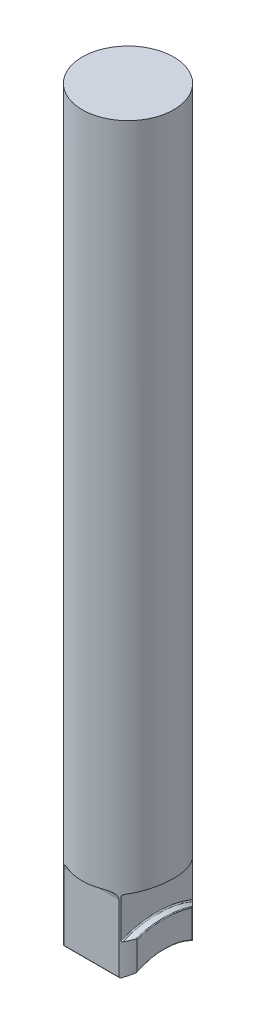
ISO-10303-21;
HEADER;
FILE_DESCRIPTION(('STEP AP214'),'2;1');
FILE_NAME('part.step','',(''),(''),'','','');
FILE_SCHEMA(('AUTOMOTIVE_DESIGN { 1 0 10303 214 1 1 1 1 }'));
ENDSEC;
DATA;
#1=APPLICATION_CONTEXT('core data for automotive mechanical design processes');
#2=APPLICATION_PROTOCOL_DEFINITION('international standard','automotive_design',2000,#1);
#3=PRODUCT_CONTEXT('',#1,'mechanical');
#4=PRODUCT('Part','Part','',(#3));
#5=PRODUCT_RELATED_PRODUCT_CATEGORY('part','',(#4));
#6=PRODUCT_DEFINITION_FORMATION('','',#4);
#7=PRODUCT_DEFINITION_CONTEXT('part definition',#1,'design');
#8=PRODUCT_DEFINITION('design','',#6,#7);
#9=PRODUCT_DEFINITION_SHAPE('','',#8);
#10=(LENGTH_UNIT() NAMED_UNIT(*) SI_UNIT(.MILLI.,.METRE.));
#11=(NAMED_UNIT(*) PLANE_ANGLE_UNIT() SI_UNIT($,.RADIAN.));
#12=(NAMED_UNIT(*) SI_UNIT($,.STERADIAN.) SOLID_ANGLE_UNIT());
#13=UNCERTAINTY_MEASURE_WITH_UNIT(LENGTH_MEASURE(1.E-05),#10,'distance_accuracy_value','');
#14=(GEOMETRIC_REPRESENTATION_CONTEXT(3) GLOBAL_UNCERTAINTY_ASSIGNED_CONTEXT((#13)) GLOBAL_UNIT_ASSIGNED_CONTEXT((#10,
#11,#12)) REPRESENTATION_CONTEXT('',''));
#15=CARTESIAN_POINT('',(0.,0.,0.));
#16=DIRECTION('',(0.,0.,1.));
#17=DIRECTION('',(1.,0.,0.));
#18=AXIS2_PLACEMENT_3D('',#15,#16,#17);
#19=CARTESIAN_POINT('',(-15.875,42.037,15.0876));
#20=DIRECTION('',(1.,0.,0.));
#21=DIRECTION('',(0.,0.,-1.));
#22=AXIS2_PLACEMENT_3D('',#19,#20,#21);
#23=CYLINDRICAL_SURFACE('',#22,2.3876);
#24=CARTESIAN_POINT('',(4.93760582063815,44.4246,15.0876));
#25=CARTESIAN_POINT('',(5.04970268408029,44.4245939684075,15.0509156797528));
#26=CARTESIAN_POINT('',(5.16139523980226,44.4237541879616,15.0129789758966));
#27=CARTESIAN_POINT('',(5.38390129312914,44.4200190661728,14.9346289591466));
#28=CARTESIAN_POINT('',(5.4947145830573,44.4171232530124,14.8942150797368));
#29=CARTESIAN_POINT('',(5.71585530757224,44.4088684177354,14.8107613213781));
#30=CARTESIAN_POINT('',(5.82617805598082,44.4034979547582,14.7677100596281));
#31=CARTESIAN_POINT('',(6.04566070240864,44.38984143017,14.6792243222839));
#32=CARTESIAN_POINT('',(6.15482068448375,44.381555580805,14.6337900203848));
#33=CARTESIAN_POINT('',(6.48273216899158,44.3513883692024,14.4929881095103));
#34=CARTESIAN_POINT('',(6.69954972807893,44.3242644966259,14.3940140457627));
#35=CARTESIAN_POINT('',(7.01911204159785,44.2695368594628,14.2394418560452));
#36=CARTESIAN_POINT('',(7.12459852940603,44.2489782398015,14.1869481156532));
#37=CARTESIAN_POINT('',(7.33341784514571,44.2024232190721,14.0801398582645));
#38=CARTESIAN_POINT('',(7.43675128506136,44.1764283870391,14.0258258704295));
#39=CARTESIAN_POINT('',(7.60695133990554,44.127821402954,13.9339843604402));
#40=CARTESIAN_POINT('',(7.67453827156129,44.1069500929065,13.8968685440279));
#41=CARTESIAN_POINT('',(7.80838112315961,44.0621085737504,13.8221088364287));
#42=CARTESIAN_POINT('',(7.87463694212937,44.0381381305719,13.7844649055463));
#43=CARTESIAN_POINT('',(8.07099595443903,43.9611532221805,13.6710431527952));
#44=CARTESIAN_POINT('',(8.19884576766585,43.9030225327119,13.5946914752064));
#45=CARTESIAN_POINT('',(8.44719970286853,43.7697302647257,13.4417963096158));
#46=CARTESIAN_POINT('',(8.56763123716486,43.6944265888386,13.3652568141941));
#47=CARTESIAN_POINT('',(8.79616961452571,43.5237422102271,13.2159568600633));
#48=CARTESIAN_POINT('',(8.90429664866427,43.4283951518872,13.143190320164));
#49=CARTESIAN_POINT('',(9.068409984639,43.2513453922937,13.0301916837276));
#50=CARTESIAN_POINT('',(9.12957674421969,43.176139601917,12.9873475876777));
#51=CARTESIAN_POINT('',(9.24164418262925,43.0154130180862,12.9078400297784));
#52=CARTESIAN_POINT('',(9.29255473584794,42.9299022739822,12.8711706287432));
#53=CARTESIAN_POINT('',(9.37446933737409,42.762998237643,12.8116013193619));
#54=CARTESIAN_POINT('',(9.40732558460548,42.6829679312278,12.7874540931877));
#55=CARTESIAN_POINT('',(9.46171992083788,42.5172759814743,12.7472599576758));
#56=CARTESIAN_POINT('',(9.48328155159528,42.431626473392,12.7311962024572));
#57=CARTESIAN_POINT('',(9.50722874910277,42.2938916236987,12.7133136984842));
#58=CARTESIAN_POINT('',(9.51386730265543,42.2429138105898,12.7083439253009));
#59=CARTESIAN_POINT('',(9.52276248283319,42.1403033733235,12.7016782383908));
#60=CARTESIAN_POINT('',(9.52501365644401,42.0886700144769,12.6999863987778));
#61=CARTESIAN_POINT('',(9.52499999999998,42.037,12.7));
#62=B_SPLINE_CURVE_WITH_KNOTS('',3,(#24,#25,#26,#27,#28,#29,#30,#31,#32,#33,#34,#35,#36,#37,#38,
#39,#40,#41,#42,#43,#44,#45,#46,#47,#48,#49,#50,#51,#52,#53,#54,#55,#56,#57,#58,#59,#60,#61),
.UNSPECIFIED.,.F.,.F.,(4,2,2,2,2,2,2,2,2,2,2,2,2,2,2,2,2,2,4),(0.,0.35383719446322,
0.707755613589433,1.06332695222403,1.41887240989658,2.13753657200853,2.49623834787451,
2.85483673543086,3.0944156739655,3.33401271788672,3.81266453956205,4.29543070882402,
4.77739289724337,5.09442025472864,5.41114091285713,5.67952941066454,5.94735624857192,
6.10203027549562,6.25689642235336),.UNSPECIFIED.);
#63=CARTESIAN_POINT('',(4.93760582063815,44.4246,15.0876));
#64=VERTEX_POINT('',#63);
#65=CARTESIAN_POINT('',(9.525,42.037,12.7));
#66=VERTEX_POINT('',#65);
#67=EDGE_CURVE('E386',#64,#66,#62,.T.);
#68=ORIENTED_EDGE('',*,*,#67,.F.);
#69=DIRECTION('',(1.,0.,0.));
#70=VECTOR('',#69,1.);
#71=CARTESIAN_POINT('',(-15.875,44.4246,15.0876));
#72=LINE('',#71,#70);
#73=CARTESIAN_POINT('',(-4.93760582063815,44.4246,15.0876));
#74=VERTEX_POINT('',#73);
#75=EDGE_CURVE('E565',#74,#64,#72,.T.);
#76=ORIENTED_EDGE('',*,*,#75,.F.);
#77=CARTESIAN_POINT('',(-9.52499999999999,42.037,12.7));
#78=CARTESIAN_POINT('',(-9.52501480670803,42.0848332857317,12.6999861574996));
#79=CARTESIAN_POINT('',(-9.52308398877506,42.1326552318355,12.701436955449));
#80=CARTESIAN_POINT('',(-9.51544592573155,42.2277804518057,12.707161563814));
#81=CARTESIAN_POINT('',(-9.50974239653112,42.2750841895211,12.7114325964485));
#82=CARTESIAN_POINT('',(-9.49475138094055,42.3682875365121,12.7226334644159));
#83=CARTESIAN_POINT('',(-9.48550163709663,42.4141966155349,12.729535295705));
#84=CARTESIAN_POINT('',(-9.46361835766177,42.5047444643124,12.7458126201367));
#85=CARTESIAN_POINT('',(-9.45098421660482,42.5493830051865,12.7551885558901));
#86=CARTESIAN_POINT('',(-9.40845479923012,42.6805861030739,12.7866274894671));
#87=CARTESIAN_POINT('',(-9.37385924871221,42.7648740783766,12.8120571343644));
#88=CARTESIAN_POINT('',(-9.29421478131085,42.9258376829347,12.8699504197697));
#89=CARTESIAN_POINT('',(-9.2491375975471,43.002491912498,12.9024330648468));
#90=CARTESIAN_POINT('',(-9.12802552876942,43.1808674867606,12.9885518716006));
#91=CARTESIAN_POINT('',(-9.04726879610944,43.2779849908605,13.0450616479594));
#92=CARTESIAN_POINT('',(-8.87309283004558,43.4556252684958,13.1641569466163));
#93=CARTESIAN_POINT('',(-8.77964900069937,43.5361150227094,13.2267542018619));
#94=CARTESIAN_POINT('',(-8.60248980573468,43.6683644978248,13.3424804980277));
#95=CARTESIAN_POINT('',(-8.52032634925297,43.7226752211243,13.3951337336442));
#96=CARTESIAN_POINT('',(-8.35134675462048,43.8227984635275,13.5011326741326));
#97=CARTESIAN_POINT('',(-8.26452763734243,43.8686054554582,13.5544788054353));
#98=CARTESIAN_POINT('',(-8.08711605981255,43.9527958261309,13.6610727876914));
#99=CARTESIAN_POINT('',(-7.99651760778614,43.9911668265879,13.7143203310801));
#100=CARTESIAN_POINT('',(-7.8123641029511,44.0613471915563,13.820053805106));
#101=CARTESIAN_POINT('',(-7.71880793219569,44.0931540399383,13.872539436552));
#102=CARTESIAN_POINT('',(-7.44466632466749,44.1769004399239,14.0226351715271));
#103=CARTESIAN_POINT('',(-7.26096196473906,44.2214578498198,14.1186917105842));
#104=CARTESIAN_POINT('',(-6.88735760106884,44.2947939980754,14.3046711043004));
#105=CARTESIAN_POINT('',(-6.69745172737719,44.3235572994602,14.394587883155));
#106=CARTESIAN_POINT('',(-6.31292485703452,44.3689357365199,14.5673285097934));
#107=CARTESIAN_POINT('',(-6.11830090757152,44.385543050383,14.6501477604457));
#108=CARTESIAN_POINT('',(-5.72552988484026,44.4095226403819,14.8080628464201));
#109=CARTESIAN_POINT('',(-5.52738461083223,44.4168995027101,14.8831625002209));
#110=CARTESIAN_POINT('',(-5.26298926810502,44.4221650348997,14.9773597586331));
#111=CARTESIAN_POINT('',(-5.19803762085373,44.4230969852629,15.000025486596));
#112=CARTESIAN_POINT('',(-5.06797257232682,44.4243138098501,15.0444670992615));
#113=CARTESIAN_POINT('',(-5.0028597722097,44.4246000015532,15.0662447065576));
#114=CARTESIAN_POINT('',(-4.93760582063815,44.4246,15.0876));
#115=B_SPLINE_CURVE_WITH_KNOTS('',3,(#77,#78,#79,#80,#81,#82,#83,#84,#85,#86,#87,#88,#89,#90,
#91,#92,#93,#94,#95,#96,#97,#98,#99,#100,#101,#102,#103,#104,#105,#106,#107,#108,#109,#110,#111,
#112,#113,#114),.UNSPECIFIED.,.F.,.F.,(4,2,2,2,2,2,2,2,2,2,2,2,2,2,2,2,2,2,4),(0.,
0.143420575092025,0.286700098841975,0.428495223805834,0.570315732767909,0.852639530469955,
1.13573371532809,1.54851814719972,1.96211456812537,2.29669621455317,2.63149457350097,
2.96684555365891,3.30232484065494,3.9373533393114,4.57300140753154,5.20905812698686,
5.84479869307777,6.05119065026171,6.25716114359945),.UNSPECIFIED.);
#116=CARTESIAN_POINT('',(-9.525,42.037,12.7));
#117=VERTEX_POINT('',#116);
#118=EDGE_CURVE('E67',#117,#74,#115,.T.);
#119=ORIENTED_EDGE('',*,*,#118,.F.);
#120=DIRECTION('',(1.,0.,0.));
#121=VECTOR('',#120,1.);
#122=CARTESIAN_POINT('',(-15.875,42.037,12.7));
#123=LINE('',#122,#121);
#124=EDGE_CURVE('E562',#117,#66,#123,.T.);
#125=ORIENTED_EDGE('',*,*,#124,.T.);
#126=EDGE_LOOP('',(#68,#76,#119,#125));
#127=FACE_BOUND('',#126,.T.);
#128=ADVANCED_FACE('F38',(#127),#23,.F.);
#129=CARTESIAN_POINT('',(-15.875,18.7190417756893,12.446));
#130=DIRECTION('',(1.,0.,0.));
#131=DIRECTION('',(0.,0.,-1.));
#132=AXIS2_PLACEMENT_3D('',#129,#130,#131);
#133=CYLINDRICAL_SURFACE('',#132,0.254);
#134=DIRECTION('',(1.,0.,0.));
#135=VECTOR('',#134,1.);
#136=CARTESIAN_POINT('',(-15.875,18.5075271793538,12.3053672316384));
#137=LINE('',#136,#135);
#138=CARTESIAN_POINT('',(10.0296342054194,18.5075271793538,12.3053672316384));
#139=VERTEX_POINT('',#138);
#140=CARTESIAN_POINT('',(-10.0296342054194,18.5075271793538,12.3053672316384));
#141=VERTEX_POINT('',#140);
#142=EDGE_CURVE('E224',#139,#141,#137,.F.);
#143=ORIENTED_EDGE('',*,*,#142,.F.);
#144=CARTESIAN_POINT('',(10.0296342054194,18.5075271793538,12.3053672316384));
#145=CARTESIAN_POINT('',(10.0188072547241,18.5016677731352,12.3141921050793));
#146=CARTESIAN_POINT('',(10.007763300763,18.4964855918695,12.3231695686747));
#147=CARTESIAN_POINT('',(9.9853550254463,18.487385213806,12.3413336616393));
#148=CARTESIAN_POINT('',(9.97399112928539,18.4834654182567,12.3505200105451));
#149=CARTESIAN_POINT('',(9.93960948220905,18.4734627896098,12.3782329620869));
#150=CARTESIAN_POINT('',(9.91624212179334,18.4691060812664,12.396962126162));
#151=CARTESIAN_POINT('',(9.86828632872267,18.4645166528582,12.4351730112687));
#152=CARTESIAN_POINT('',(9.8436851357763,18.4644461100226,12.4546564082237));
#153=CARTESIAN_POINT('',(9.79455690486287,18.4687318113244,12.4933284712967));
#154=CARTESIAN_POINT('',(9.77003002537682,18.4730944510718,12.5125166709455));
#155=CARTESIAN_POINT('',(9.72607298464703,18.485286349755,12.5467031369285));
#156=CARTESIAN_POINT('',(9.70652667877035,18.4923414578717,12.5618290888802));
#157=CARTESIAN_POINT('',(9.66838059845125,18.5099421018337,12.5912118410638));
#158=CARTESIAN_POINT('',(9.64977868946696,18.5204793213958,12.6054706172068));
#159=CARTESIAN_POINT('',(9.62104291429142,18.5408851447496,12.6274048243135));
#160=CARTESIAN_POINT('',(9.61036549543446,18.5495015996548,12.6355318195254));
#161=CARTESIAN_POINT('',(9.59004075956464,18.5685247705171,12.6509645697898));
#162=CARTESIAN_POINT('',(9.58039222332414,18.578929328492,12.6582712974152));
#163=CARTESIAN_POINT('',(9.56504258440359,18.5986629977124,12.6698718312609));
#164=CARTESIAN_POINT('',(9.55897535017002,18.6075375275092,12.6744491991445));
#165=CARTESIAN_POINT('',(9.54800933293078,18.6263675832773,12.6827122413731));
#166=CARTESIAN_POINT('',(9.54310892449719,18.6363215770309,12.6863991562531));
#167=CARTESIAN_POINT('',(9.53572716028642,18.6550126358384,12.6919482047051));
#168=CARTESIAN_POINT('',(9.53295410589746,18.6635678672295,12.6940308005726));
#169=CARTESIAN_POINT('',(9.52858439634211,18.6811264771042,12.6973112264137));
#170=CARTESIAN_POINT('',(9.52698496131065,18.6901287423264,12.6985111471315));
#171=CARTESIAN_POINT('',(9.52534361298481,18.7057992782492,12.6997422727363));
#172=CARTESIAN_POINT('',(9.52499190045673,18.7124189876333,12.7000059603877));
#173=CARTESIAN_POINT('',(9.525,18.7190417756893,12.7));
#174=B_SPLINE_CURVE_WITH_KNOTS('',3,(#144,#145,#146,#147,#148,#149,#150,#151,#152,#153,#154,
#155,#156,#157,#158,#159,#160,#161,#162,#163,#164,#165,#166,#167,#168,#169,#170,#171,#172,#173),
.UNSPECIFIED.,.F.,.F.,(4,2,2,2,2,2,2,2,2,2,2,2,2,2,4),(0.,0.0453949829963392,0.0907322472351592,
0.181161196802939,0.275009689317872,0.368993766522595,0.44589658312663,0.522617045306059,
0.57034468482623,0.618015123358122,0.652957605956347,0.687851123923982,0.715435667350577,
0.742954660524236,0.762806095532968),.UNSPECIFIED.);
#175=CARTESIAN_POINT('',(9.525,18.7190417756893,12.7));
#176=VERTEX_POINT('',#175);
#177=EDGE_CURVE('E370',#139,#176,#174,.T.);
#178=ORIENTED_EDGE('',*,*,#177,.T.);
#179=DIRECTION('',(1.,0.,0.));
#180=VECTOR('',#179,1.);
#181=CARTESIAN_POINT('',(-15.875,18.7190417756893,12.7));
#182=LINE('',#181,#180);
#183=CARTESIAN_POINT('',(-9.525,18.7190417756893,12.7));
#184=VERTEX_POINT('',#183);
#185=EDGE_CURVE('E242',#184,#176,#182,.T.);
#186=ORIENTED_EDGE('',*,*,#185,.F.);
#187=CARTESIAN_POINT('',(-9.525,18.7190417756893,12.7));
#188=CARTESIAN_POINT('',(-9.52497281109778,18.7085499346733,12.7000199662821));
#189=CARTESIAN_POINT('',(-9.52586494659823,18.6981017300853,12.699351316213));
#190=CARTESIAN_POINT('',(-9.52923677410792,18.6777422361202,12.6968215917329));
#191=CARTESIAN_POINT('',(-9.53169661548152,18.6678258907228,12.6949754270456));
#192=CARTESIAN_POINT('',(-9.53794881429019,18.6487486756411,12.6902786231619));
#193=CARTESIAN_POINT('',(-9.54173480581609,18.6395844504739,12.6874327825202));
#194=CARTESIAN_POINT('',(-9.55036434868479,18.6220490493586,12.680938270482));
#195=CARTESIAN_POINT('',(-9.55521147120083,18.6136806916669,12.6772868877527));
#196=CARTESIAN_POINT('',(-9.56864308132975,18.5933491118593,12.6671543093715));
#197=CARTESIAN_POINT('',(-9.57780301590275,18.5819882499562,12.6602315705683));
#198=CARTESIAN_POINT('',(-9.59738215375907,18.5611776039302,12.6453957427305));
#199=CARTESIAN_POINT('',(-9.60780389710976,18.5517317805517,12.6374806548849));
#200=CARTESIAN_POINT('',(-9.63588560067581,18.5294499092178,12.6160928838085));
#201=CARTESIAN_POINT('',(-9.65418001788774,18.5179143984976,12.6021026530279));
#202=CARTESIAN_POINT('',(-9.69187506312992,18.4984586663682,12.5731362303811));
#203=CARTESIAN_POINT('',(-9.71127854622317,18.4905482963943,12.5581574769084));
#204=CARTESIAN_POINT('',(-9.75855242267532,18.4754123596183,12.5214812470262));
#205=CARTESIAN_POINT('',(-9.78669907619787,18.4697322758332,12.4994973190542));
#206=CARTESIAN_POINT('',(-9.84313481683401,18.4642232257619,12.4551038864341));
#207=CARTESIAN_POINT('',(-9.87142367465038,18.4643867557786,12.4326949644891));
#208=CARTESIAN_POINT('',(-9.92183865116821,18.4700905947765,12.3924801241));
#209=CARTESIAN_POINT('',(-9.94406438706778,18.4745475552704,12.3746511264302));
#210=CARTESIAN_POINT('',(-9.97675369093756,18.4844010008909,12.3482876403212));
#211=CARTESIAN_POINT('',(-9.98754573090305,18.4882154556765,12.3395600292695));
#212=CARTESIAN_POINT('',(-10.0088361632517,18.4969901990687,12.3222973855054));
#213=CARTESIAN_POINT('',(-10.0193341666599,18.5019519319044,12.313762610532));
#214=CARTESIAN_POINT('',(-10.0296342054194,18.5075271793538,12.3053672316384));
#215=B_SPLINE_CURVE_WITH_KNOTS('',3,(#187,#188,#189,#190,#191,#192,#193,#194,#195,#196,#197,
#198,#199,#200,#201,#202,#203,#204,#205,#206,#207,#208,#209,#210,#211,#212,#213,#214),
.UNSPECIFIED.,.F.,.F.,(4,2,2,2,2,2,2,2,2,2,2,2,2,4),(0.,0.0313473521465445,0.062305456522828,
0.093116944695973,0.124033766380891,0.172216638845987,0.220498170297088,0.297344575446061,
0.374398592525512,0.482339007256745,0.590140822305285,0.676353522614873,0.719491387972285,
0.76268385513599),.UNSPECIFIED.);
#216=EDGE_CURVE('E507',#184,#141,#215,.T.);
#217=ORIENTED_EDGE('',*,*,#216,.T.);
#218=EDGE_LOOP('',(#143,#178,#186,#217));
#219=FACE_BOUND('',#218,.T.);
#220=ADVANCED_FACE('F514',(#219),#133,.T.);
#221=CARTESIAN_POINT('',(-15.875,0.,12.7));
#222=DIRECTION('',(0.,0.,-1.));
#223=DIRECTION('',(0.,1.,0.));
#224=AXIS2_PLACEMENT_3D('',#221,#222,#223);
#225=PLANE('',#224);
#226=DIRECTION('',(0.,1.,0.));
#227=VECTOR('',#226,1.);
#228=CARTESIAN_POINT('',(-9.525,18.4650417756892,12.7));
#229=LINE('',#228,#227);
#230=EDGE_CURVE('E513',#184,#117,#229,.T.);
#231=ORIENTED_EDGE('',*,*,#230,.F.);
#232=ORIENTED_EDGE('',*,*,#185,.T.);
#233=DIRECTION('',(0.,1.,0.));
#234=VECTOR('',#233,1.);
#235=CARTESIAN_POINT('',(9.525,18.4650417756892,12.7));
#236=LINE('',#235,#234);
#237=EDGE_CURVE('E661',#66,#176,#236,.F.);
#238=ORIENTED_EDGE('',*,*,#237,.F.);
#239=ORIENTED_EDGE('',*,*,#124,.F.);
#240=EDGE_LOOP('',(#231,#232,#238,#239));
#241=FACE_BOUND('',#240,.T.);
#242=ADVANCED_FACE('F517',(#241),#225,.F.);
#243=CARTESIAN_POINT('',(-15.875,44.4246,15.0876));
#244=DIRECTION('',(0.,1.,0.));
#245=DIRECTION('',(0.,0.,1.));
#246=AXIS2_PLACEMENT_3D('',#243,#244,#245);
#247=PLANE('',#246);
#248=ORIENTED_EDGE('',*,*,#75,.T.);
#249=CARTESIAN_POINT('',(0.,44.4246,0.));
#250=DIRECTION('',(0.,1.,0.));
#251=DIRECTION('',(0.,0.,1.));
#252=AXIS2_PLACEMENT_3D('',#249,#250,#251);
#253=CIRCLE('',#252,15.875);
#254=EDGE_CURVE('E554',#74,#64,#253,.T.);
#255=ORIENTED_EDGE('',*,*,#254,.F.);
#256=EDGE_LOOP('',(#248,#255));
#257=FACE_BOUND('',#256,.T.);
#258=ADVANCED_FACE('F543',(#257),#247,.F.);
#259=CARTESIAN_POINT('',(10.668,0.,0.));
#260=DIRECTION('',(1.,0.,0.));
#261=DIRECTION('',(0.,0.,-1.));
#262=AXIS2_PLACEMENT_3D('',#259,#260,#261);
#263=TOROIDAL_SURFACE('',#262,44.45,0.762);
#264=CARTESIAN_POINT('',(9.92051731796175,42.5331089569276,12.3935047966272));
#265=CARTESIAN_POINT('',(9.91309582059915,42.5701749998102,12.3994388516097));
#266=CARTESIAN_POINT('',(9.90862888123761,42.6080607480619,12.4030102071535));
#267=CARTESIAN_POINT('',(9.90512959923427,42.6839329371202,12.4058082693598));
#268=CARTESIAN_POINT('',(9.90605058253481,42.7219156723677,12.4050722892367));
#269=CARTESIAN_POINT('',(9.91272750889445,42.7969689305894,12.3997364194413));
#270=CARTESIAN_POINT('',(9.91846324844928,42.8340426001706,12.3951526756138));
#271=CARTESIAN_POINT('',(9.93409291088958,42.9067807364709,12.3826299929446));
#272=CARTESIAN_POINT('',(9.94399724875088,42.9424414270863,12.3746826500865));
#273=CARTESIAN_POINT('',(9.97237133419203,43.0267348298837,12.3518375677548));
#274=CARTESIAN_POINT('',(9.99269293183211,43.0743352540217,12.3354205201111));
#275=CARTESIAN_POINT('',(10.0389252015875,43.1646675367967,12.2978247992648));
#276=CARTESIAN_POINT('',(10.0648440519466,43.2073921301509,12.2766391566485));
#277=CARTESIAN_POINT('',(10.1289255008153,43.2989643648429,12.2238562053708));
#278=CARTESIAN_POINT('',(10.1684767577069,43.346119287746,12.1910094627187));
#279=CARTESIAN_POINT('',(10.2525425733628,43.4314538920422,12.1203966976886));
#280=CARTESIAN_POINT('',(10.2970628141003,43.4696231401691,12.0826250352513));
#281=CARTESIAN_POINT('',(10.39014895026,43.5372540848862,12.0026769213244));
#282=CARTESIAN_POINT('',(10.4387648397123,43.5665790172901,11.9604437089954));
#283=CARTESIAN_POINT('',(10.5380656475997,43.615431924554,11.8730428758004));
#284=CARTESIAN_POINT('',(10.5887464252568,43.6349785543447,11.8278810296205));
#285=CARTESIAN_POINT('',(10.6643064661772,43.6562774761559,11.7596471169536));
#286=CARTESIAN_POINT('',(10.6888275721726,43.6619906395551,11.7373656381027));
#287=CARTESIAN_POINT('',(10.7133875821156,43.6665049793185,11.7149029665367));
#288=B_SPLINE_CURVE_WITH_KNOTS('',3,(#264,#265,#266,#267,#268,#269,#270,#271,#272,#273,#274,
#275,#276,#277,#278,#279,#280,#281,#282,#283,#284,#285,#286,#287),.UNSPECIFIED.,.F.,.F.,(4,2,2,
2,2,2,2,2,2,2,2,4),(0.,0.114394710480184,0.227799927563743,0.340731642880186,0.45394720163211,
0.615951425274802,0.778193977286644,0.986385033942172,1.19481664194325,1.40632311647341,
1.61742452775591,1.71819996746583),.UNSPECIFIED.);
#289=CARTESIAN_POINT('',(9.906,42.6839045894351,12.4051114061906));
#290=VERTEX_POINT('',#289);
#291=CARTESIAN_POINT('',(10.668,43.6567926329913,11.7562494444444));
#292=VERTEX_POINT('',#291);
#293=EDGE_CURVE('E378',#290,#292,#288,.T.);
#294=ORIENTED_EDGE('',*,*,#293,.F.);
#295=CARTESIAN_POINT('',(9.906,0.,0.));
#296=DIRECTION('',(1.,0.,0.));
#297=DIRECTION('',(0.,0.,-1.));
#298=AXIS2_PLACEMENT_3D('',#295,#296,#297);
#299=CIRCLE('',#298,44.45);
#300=CARTESIAN_POINT('',(9.906,42.6839045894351,-12.4051114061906));
#301=VERTEX_POINT('',#300);
#302=EDGE_CURVE('E576',#301,#290,#299,.T.);
#303=ORIENTED_EDGE('',*,*,#302,.F.);
#304=CARTESIAN_POINT('',(10.7133875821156,43.6665049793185,-11.7149029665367));
#305=CARTESIAN_POINT('',(10.6842958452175,43.6611558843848,-11.741508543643));
#306=CARTESIAN_POINT('',(10.6552900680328,43.6541342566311,-11.767834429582));
#307=CARTESIAN_POINT('',(10.5976238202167,43.6368373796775,-11.8197926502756));
#308=CARTESIAN_POINT('',(10.5689633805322,43.6265618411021,-11.845424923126));
#309=CARTESIAN_POINT('',(10.4833680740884,43.5908264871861,-11.9214280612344));
#310=CARTESIAN_POINT('',(10.4272339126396,43.5605355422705,-11.9705266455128));
#311=CARTESIAN_POINT('',(10.3191153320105,43.4877096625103,-12.0638548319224));
#312=CARTESIAN_POINT('',(10.2671280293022,43.4451833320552,-12.1080878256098));
#313=CARTESIAN_POINT('',(10.1696814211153,43.3482527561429,-12.1900462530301));
#314=CARTESIAN_POINT('',(10.1241987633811,43.2938928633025,-12.2277950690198));
#315=CARTESIAN_POINT('',(10.0570782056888,43.1948414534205,-12.2829960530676));
#316=CARTESIAN_POINT('',(10.0326591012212,43.1533995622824,-12.3029333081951));
#317=CARTESIAN_POINT('',(9.98906937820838,43.0660374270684,-12.338350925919));
#318=CARTESIAN_POINT('',(9.96989418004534,43.0201211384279,-12.3538351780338));
#319=CARTESIAN_POINT('',(9.94151532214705,42.9344057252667,-12.3766781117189));
#320=CARTESIAN_POINT('',(9.93107204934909,42.8952900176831,-12.3850528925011));
#321=CARTESIAN_POINT('',(9.9152765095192,42.8154641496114,-12.3977021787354));
#322=CARTESIAN_POINT('',(9.90990943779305,42.7747589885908,-12.4019886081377));
#323=CARTESIAN_POINT('',(9.90550349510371,42.7002573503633,-12.4055083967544));
#324=CARTESIAN_POINT('',(9.90548689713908,42.6665586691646,-12.4055224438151));
#325=CARTESIAN_POINT('',(9.90970086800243,42.5993892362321,-12.4021544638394));
#326=CARTESIAN_POINT('',(9.9139593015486,42.5659214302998,-12.3987501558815));
#327=CARTESIAN_POINT('',(9.92051731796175,42.5331089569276,-12.3935047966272));
#328=B_SPLINE_CURVE_WITH_KNOTS('',3,(#304,#305,#306,#307,#308,#309,#310,#311,#312,#313,#314,
#315,#316,#317,#318,#319,#320,#321,#322,#323,#324,#325,#326,#327),.UNSPECIFIED.,.F.,.F.,(4,2,2,
2,2,2,2,2,2,2,2,4),(0.,0.119269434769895,0.238549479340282,0.478789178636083,0.718860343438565,
0.958046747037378,1.11373341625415,1.26928368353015,1.39285084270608,1.51605649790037,
1.61673233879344,1.71806867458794),.UNSPECIFIED.);
#329=CARTESIAN_POINT('',(10.668,43.6567926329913,-11.7562494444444));
#330=VERTEX_POINT('',#329);
#331=EDGE_CURVE('E314',#330,#301,#328,.T.);
#332=ORIENTED_EDGE('',*,*,#331,.F.);
#333=CARTESIAN_POINT('',(10.668,0.,0.));
#334=DIRECTION('',(1.,0.,0.));
#335=DIRECTION('',(0.,0.,-1.));
#336=AXIS2_PLACEMENT_3D('',#333,#334,#335);
#337=CIRCLE('',#336,45.212);
#338=EDGE_CURVE('E573',#292,#330,#337,.F.);
#339=ORIENTED_EDGE('',*,*,#338,.F.);
#340=EDGE_LOOP('',(#294,#303,#332,#339));
#341=FACE_BOUND('',#340,.T.);
#342=ADVANCED_FACE('F652',(#341),#263,.F.);
#343=CARTESIAN_POINT('',(-8.84822894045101,0.,0.));
#344=DIRECTION('',(-1.,0.,0.));
#345=DIRECTION('',(0.,0.,1.));
#346=AXIS2_PLACEMENT_3D('',#343,#344,#345);
#347=CYLINDRICAL_SURFACE('',#346,45.212);
#348=ORIENTED_EDGE('',*,*,#338,.T.);
#349=CARTESIAN_POINT('',(10.668,43.6567926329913,-11.7562494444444));
#350=CARTESIAN_POINT('',(10.9968267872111,43.7371520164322,-11.4578941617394));
#351=CARTESIAN_POINT('',(11.3130533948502,43.8179127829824,-11.1457544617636));
#352=CARTESIAN_POINT('',(11.9184518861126,43.9781014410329,-10.495864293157));
#353=CARTESIAN_POINT('',(12.2076202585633,44.0575291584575,-10.1581105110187));
#354=CARTESIAN_POINT('',(12.7573869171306,44.2130143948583,-9.45848749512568));
#355=CARTESIAN_POINT('',(13.0179402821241,44.2890665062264,-9.09658173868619));
#356=CARTESIAN_POINT('',(13.5081240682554,44.4356164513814,-8.35135252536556));
#357=CARTESIAN_POINT('',(13.7377561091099,44.5061145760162,-7.96803019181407));
#358=CARTESIAN_POINT('',(14.1646981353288,44.6397447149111,-7.18174035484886));
#359=CARTESIAN_POINT('',(14.3619563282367,44.7028648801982,-6.77874268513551));
#360=CARTESIAN_POINT('',(14.7220642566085,44.8198558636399,-5.95633668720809));
#361=CARTESIAN_POINT('',(14.88491334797,44.8737265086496,-5.53692805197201));
#362=CARTESIAN_POINT('',(15.1745757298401,44.9706398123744,-4.68508821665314));
#363=CARTESIAN_POINT('',(15.3014247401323,45.0136931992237,-4.25267039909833));
#364=CARTESIAN_POINT('',(15.5180628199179,45.0877945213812,-3.37764326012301));
#365=CARTESIAN_POINT('',(15.6078535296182,45.1188429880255,-2.93503439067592));
#366=CARTESIAN_POINT('',(15.7468636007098,45.1671224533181,-2.05941112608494));
#367=CARTESIAN_POINT('',(15.797447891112,45.1848176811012,-1.62663867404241));
#368=CARTESIAN_POINT('',(15.86286880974,45.2077314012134,-0.758072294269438));
#369=CARTESIAN_POINT('',(15.8777062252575,45.212950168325,-0.322278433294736));
#370=CARTESIAN_POINT('',(15.8714845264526,45.2107656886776,0.548964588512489));
#371=CARTESIAN_POINT('',(15.8504298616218,45.2033640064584,0.984413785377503));
#372=CARTESIAN_POINT('',(15.7726450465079,45.1761477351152,1.85171621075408));
#373=CARTESIAN_POINT('',(15.7159153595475,45.1563333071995,2.2835694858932));
#374=CARTESIAN_POINT('',(15.5696980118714,45.1056568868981,3.12689113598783));
#375=CARTESIAN_POINT('',(15.4813039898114,45.0751644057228,3.5385720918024));
#376=CARTESIAN_POINT('',(15.2723843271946,45.003837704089,4.35276207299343));
#377=CARTESIAN_POINT('',(15.1518596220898,44.9630037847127,4.75527136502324));
#378=CARTESIAN_POINT('',(14.8795890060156,44.8719848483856,5.54883429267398));
#379=CARTESIAN_POINT('',(14.7278194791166,44.8217927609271,5.93987900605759));
#380=CARTESIAN_POINT('',(14.3943076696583,44.7133152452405,6.70781684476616));
#381=CARTESIAN_POINT('',(14.2125632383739,44.6550292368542,7.08470895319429));
#382=CARTESIAN_POINT('',(13.8012705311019,44.5257524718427,7.85815806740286));
#383=CARTESIAN_POINT('',(13.568787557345,44.4540769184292,8.25304288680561));
#384=CARTESIAN_POINT('',(13.0711569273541,44.3047193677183,9.02051661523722));
#385=CARTESIAN_POINT('',(12.806004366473,44.2270364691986,9.39310216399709));
#386=CARTESIAN_POINT('',(12.2451705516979,44.067916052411,10.1133361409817));
#387=CARTESIAN_POINT('',(11.9495059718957,43.9864805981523,10.4609980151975));
#388=CARTESIAN_POINT('',(11.3296468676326,43.8221535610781,11.1293596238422));
#389=CARTESIAN_POINT('',(11.0054588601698,43.7392623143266,11.4500654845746));
#390=CARTESIAN_POINT('',(10.668,43.6567926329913,11.7562494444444));
#391=B_SPLINE_CURVE_WITH_KNOTS('',3,(#349,#350,#351,#352,#353,#354,#355,#356,#357,#358,#359,
#360,#361,#362,#363,#364,#365,#366,#367,#368,#369,#370,#371,#372,#373,#374,#375,#376,#377,#378,
#379,#380,#381,#382,#383,#384,#385,#386,#387,#388,#389,#390),.UNSPECIFIED.,.F.,.F.,(4,2,2,2,2,2,
2,2,2,2,2,2,2,2,2,2,2,2,2,2,4),(0.,1.35328805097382,2.70675146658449,4.06231012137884,
5.41779774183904,6.77543319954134,8.13309406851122,9.48940309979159,10.8456520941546,
12.1522504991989,13.458820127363,14.7652277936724,16.0716184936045,17.3366611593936,
18.601666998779,19.8676325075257,21.1336888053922,22.5233426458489,23.9132053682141,
25.3023125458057,26.6911031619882),.UNSPECIFIED.);
#392=EDGE_CURVE('E323',#330,#292,#391,.T.);
#393=ORIENTED_EDGE('',*,*,#392,.T.);
#394=EDGE_LOOP('',(#348,#393));
#395=FACE_BOUND('',#394,.T.);
#396=ADVANCED_FACE('F545',(#395),#347,.F.);
#397=CARTESIAN_POINT('',(10.287,0.,0.));
#398=DIRECTION('',(1.,0.,0.));
#399=DIRECTION('',(0.,0.,-1.));
#400=AXIS2_PLACEMENT_3D('',#397,#398,#399);
#401=TOROIDAL_SURFACE('',#400,32.131,0.381);
#402=CARTESIAN_POINT('',(10.3139238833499,29.3680844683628,12.0680818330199));
#403=CARTESIAN_POINT('',(10.2908184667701,29.3582318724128,12.0878333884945));
#404=CARTESIAN_POINT('',(10.2670244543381,29.3503437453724,12.1080496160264));
#405=CARTESIAN_POINT('',(10.2183955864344,29.3394852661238,12.1491156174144));
#406=CARTESIAN_POINT('',(10.1935517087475,29.3365746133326,12.1699700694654));
#407=CARTESIAN_POINT('',(10.1516930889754,29.3368866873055,12.2048861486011));
#408=CARTESIAN_POINT('',(10.1347116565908,29.3384476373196,12.2189903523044));
#409=CARTESIAN_POINT('',(10.1011109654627,29.3448950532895,12.2467813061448));
#410=CARTESIAN_POINT('',(10.0844905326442,29.3497682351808,12.2604694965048));
#411=CARTESIAN_POINT('',(10.0551519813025,29.3619976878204,12.2845363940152));
#412=CARTESIAN_POINT('',(10.0422860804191,29.3687178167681,12.2950547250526));
#413=CARTESIAN_POINT('',(10.0175385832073,29.3848016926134,12.3152263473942));
#414=CARTESIAN_POINT('',(10.005656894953,29.3941651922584,12.3248797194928));
#415=CARTESIAN_POINT('',(9.98329394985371,29.4156155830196,12.3430011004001));
#416=CARTESIAN_POINT('',(9.97282432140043,29.4277231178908,12.3514592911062));
#417=CARTESIAN_POINT('',(9.95391582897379,29.4543372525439,12.3667025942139));
#418=CARTESIAN_POINT('',(9.94547543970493,29.468842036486,12.3734889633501));
#419=CARTESIAN_POINT('',(9.93193186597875,29.4976752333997,12.3843619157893));
#420=CARTESIAN_POINT('',(9.92653693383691,29.5117796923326,12.3886852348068));
#421=CARTESIAN_POINT('',(9.9176393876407,29.5409329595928,12.3958092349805));
#422=CARTESIAN_POINT('',(9.91413691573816,29.5559818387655,12.3986098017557));
#423=CARTESIAN_POINT('',(9.90894109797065,29.5868489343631,12.4027627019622));
#424=CARTESIAN_POINT('',(9.90728045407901,29.6026760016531,12.404088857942));
#425=CARTESIAN_POINT('',(9.90573747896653,29.6344652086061,12.405321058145));
#426=CARTESIAN_POINT('',(9.90585609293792,29.650427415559,12.4052263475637));
#427=CARTESIAN_POINT('',(9.90813247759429,29.6898238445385,12.4034083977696));
#428=CARTESIAN_POINT('',(9.91124100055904,29.7131698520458,12.4009258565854));
#429=CARTESIAN_POINT('',(9.92035151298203,29.7589168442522,12.393638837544));
#430=CARTESIAN_POINT('',(9.92635971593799,29.7813156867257,12.38882937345));
#431=CARTESIAN_POINT('',(9.94325901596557,29.8324154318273,12.3752729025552));
#432=CARTESIAN_POINT('',(9.95512265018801,29.860584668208,12.3657373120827));
#433=CARTESIAN_POINT('',(9.98216267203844,29.9141155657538,12.3439197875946));
#434=CARTESIAN_POINT('',(9.99734397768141,29.9394729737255,12.3316337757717));
#435=CARTESIAN_POINT('',(10.0344831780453,29.9931872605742,12.3014421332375));
#436=CARTESIAN_POINT('',(10.0571833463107,30.0206749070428,12.2829014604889));
#437=CARTESIAN_POINT('',(10.1056223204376,30.0704616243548,12.2430800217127));
#438=CARTESIAN_POINT('',(10.1313617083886,30.0927596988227,12.2217987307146));
#439=CARTESIAN_POINT('',(10.1826762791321,30.1299576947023,12.1790695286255));
#440=CARTESIAN_POINT('',(10.2080556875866,30.1453443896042,12.1578108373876));
#441=CARTESIAN_POINT('',(10.2601279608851,30.1708602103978,12.113900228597));
#442=CARTESIAN_POINT('',(10.2868187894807,30.1809972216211,12.0912504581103));
#443=CARTESIAN_POINT('',(10.313923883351,30.18823629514,12.0680818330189));
#444=B_SPLINE_CURVE_WITH_KNOTS('',3,(#402,#403,#404,#405,#406,#407,#408,#409,#410,#411,#412,
#413,#414,#415,#416,#417,#418,#419,#420,#421,#422,#423,#424,#425,#426,#427,#428,#429,#430,#431,
#432,#433,#434,#435,#436,#437,#438,#439,#440,#441,#442,#443),.UNSPECIFIED.,.F.,.F.,(4,2,2,2,2,2,
2,2,2,2,2,2,2,2,2,2,2,2,2,2,4),(0.,0.0960829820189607,0.193310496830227,0.25949015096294,
0.325405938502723,0.37897414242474,0.432537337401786,0.486517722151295,0.540457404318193,
0.58735869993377,0.634263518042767,0.681988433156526,0.729738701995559,0.800391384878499,
0.871196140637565,0.966733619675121,1.06241369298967,1.18234938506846,1.30230808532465,
1.41141525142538,1.52035805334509),.UNSPECIFIED.);
#445=CARTESIAN_POINT('',(10.287,29.3576096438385,12.0910403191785));
#446=VERTEX_POINT('',#445);
#447=CARTESIAN_POINT('',(9.90599999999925,29.6397431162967,12.4051114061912));
#448=VERTEX_POINT('',#447);
#449=EDGE_CURVE('E355',#446,#448,#444,.T.);
#450=ORIENTED_EDGE('',*,*,#449,.F.);
#451=CARTESIAN_POINT('',(10.287,0.,0.));
#452=DIRECTION('',(1.,0.,0.));
#453=DIRECTION('',(0.,0.,-1.));
#454=AXIS2_PLACEMENT_3D('',#451,#452,#453);
#455=CIRCLE('',#454,31.75);
#456=CARTESIAN_POINT('',(10.287,29.3576096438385,-12.0910403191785));
#457=VERTEX_POINT('',#456);
#458=EDGE_CURVE('E227',#457,#446,#455,.T.);
#459=ORIENTED_EDGE('',*,*,#458,.F.);
#460=CARTESIAN_POINT('',(10.313923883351,30.18823629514,-12.0680818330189));
#461=CARTESIAN_POINT('',(10.2992347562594,30.1843331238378,-12.0806360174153));
#462=CARTESIAN_POINT('',(10.2846684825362,30.1795616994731,-12.0930383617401));
#463=CARTESIAN_POINT('',(10.2558656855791,30.1683960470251,-12.1174749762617));
#464=CARTESIAN_POINT('',(10.2416289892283,30.1620026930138,-12.1295094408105));
#465=CARTESIAN_POINT('',(10.1994852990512,30.1405368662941,-12.1650101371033));
#466=CARTESIAN_POINT('',(10.1721767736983,30.1231875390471,-12.1878462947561));
#467=CARTESIAN_POINT('',(10.1196810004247,30.0829360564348,-12.2314699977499));
#468=CARTESIAN_POINT('',(10.0945122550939,30.0599910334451,-12.252239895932));
#469=CARTESIAN_POINT('',(10.0473066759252,30.0090415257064,-12.2909797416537));
#470=CARTESIAN_POINT('',(10.0252678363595,29.9810403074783,-12.3089514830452));
#471=CARTESIAN_POINT('',(9.98996948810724,29.9273433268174,-12.3376062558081));
#472=CARTESIAN_POINT('',(9.97585602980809,29.9025942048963,-12.3490153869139));
#473=CARTESIAN_POINT('',(9.95079396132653,29.850549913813,-12.3692191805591));
#474=CARTESIAN_POINT('',(9.93984027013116,29.8232589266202,-12.3780180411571));
#475=CARTESIAN_POINT('',(9.92431035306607,29.7738973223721,-12.3904705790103));
#476=CARTESIAN_POINT('',(9.9188173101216,29.752303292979,-12.3948664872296));
#477=CARTESIAN_POINT('',(9.91054600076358,29.7082683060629,-12.4014810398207));
#478=CARTESIAN_POINT('',(9.90776409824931,29.6858285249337,-12.4037026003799));
#479=CARTESIAN_POINT('',(9.90569037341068,29.6453628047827,-12.4053586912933));
#480=CARTESIAN_POINT('',(9.90579314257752,29.6273892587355,-12.4052766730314));
#481=CARTESIAN_POINT('',(9.90829389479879,29.5916949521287,-12.4032794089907));
#482=CARTESIAN_POINT('',(9.91069051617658,29.5739740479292,-12.4013652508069));
#483=CARTESIAN_POINT('',(9.91797951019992,29.5392253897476,-12.3955366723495));
#484=CARTESIAN_POINT('',(9.92289164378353,29.5222042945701,-12.3916064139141));
#485=CARTESIAN_POINT('',(9.93520834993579,29.4897194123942,-12.381733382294));
#486=CARTESIAN_POINT('',(9.94261098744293,29.4742544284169,-12.3757921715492));
#487=CARTESIAN_POINT('',(9.95853494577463,29.4473757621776,-12.3629808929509));
#488=CARTESIAN_POINT('',(9.9667885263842,29.4356968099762,-12.3563297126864));
#489=CARTESIAN_POINT('',(9.98467909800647,29.4142750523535,-12.3418775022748));
#490=CARTESIAN_POINT('',(9.99431629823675,29.4045325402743,-12.3340762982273));
#491=CARTESIAN_POINT('',(10.0147108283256,29.3870287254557,-12.3175227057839));
#492=CARTESIAN_POINT('',(10.0254770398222,29.3792850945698,-12.3087627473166));
#493=CARTESIAN_POINT('',(10.04771841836,29.3658574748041,-12.2906137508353));
#494=CARTESIAN_POINT('',(10.0591935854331,29.3601734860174,-12.2812247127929));
#495=CARTESIAN_POINT('',(10.0884786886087,29.3483592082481,-12.2571912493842));
#496=CARTESIAN_POINT('',(10.1065659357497,29.3434483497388,-12.2422835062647));
#497=CARTESIAN_POINT('',(10.1431005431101,29.3374294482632,-12.2120311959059));
#498=CARTESIAN_POINT('',(10.1615492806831,29.3363411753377,-12.1966847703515));
#499=CARTESIAN_POINT('',(10.2029370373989,29.3375749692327,-12.1620966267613));
#500=CARTESIAN_POINT('',(10.225835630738,29.3408258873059,-12.1428481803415));
#501=CARTESIAN_POINT('',(10.2706459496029,29.3515527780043,-12.1049711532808));
#502=CARTESIAN_POINT('',(10.2925666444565,29.35897316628,-12.0863377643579));
#503=CARTESIAN_POINT('',(10.3139238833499,29.3680844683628,-12.0680818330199));
#504=B_SPLINE_CURVE_WITH_KNOTS('',3,(#460,#461,#462,#463,#464,#465,#466,#467,#468,#469,#470,
#471,#472,#473,#474,#475,#476,#477,#478,#479,#480,#481,#482,#483,#484,#485,#486,#487,#488,#489,
#490,#491,#492,#493,#494,#495,#496,#497,#498,#499,#500,#501,#502,#503),.UNSPECIFIED.,.F.,.F.,(4,
2,2,2,2,2,2,2,2,2,2,2,2,2,2,2,2,2,2,2,2,4),(0.,0.0590913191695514,0.1181508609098,
0.236397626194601,0.355580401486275,0.474686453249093,0.566447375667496,0.658059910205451,
0.725965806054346,0.793780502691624,0.847494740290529,0.901177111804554,0.955287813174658,
1.00935656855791,1.05644612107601,1.10354280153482,1.15104260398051,1.19854240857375,
1.26998698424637,1.34180052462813,1.43171717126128,1.52046262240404),.UNSPECIFIED.);
#505=CARTESIAN_POINT('',(9.90599999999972,29.6397431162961,-12.4051114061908));
#506=VERTEX_POINT('',#505);
#507=EDGE_CURVE('E290',#506,#457,#504,.T.);
#508=ORIENTED_EDGE('',*,*,#507,.F.);
#509=CARTESIAN_POINT('',(9.906,0.,0.));
#510=DIRECTION('',(1.,0.,0.));
#511=DIRECTION('',(0.,0.,-1.));
#512=AXIS2_PLACEMENT_3D('',#509,#510,#511);
#513=CIRCLE('',#512,32.131);
#514=EDGE_CURVE('E585',#448,#506,#513,.F.);
#515=ORIENTED_EDGE('',*,*,#514,.F.);
#516=EDGE_LOOP('',(#450,#459,#508,#515));
#517=FACE_BOUND('',#516,.T.);
#518=ADVANCED_FACE('F595',(#517),#401,.F.);
#519=CARTESIAN_POINT('',(12.446,0.,0.));
#520=DIRECTION('',(-1.,0.,0.));
#521=DIRECTION('',(0.,0.,1.));
#522=AXIS2_PLACEMENT_3D('',#519,#520,#521);
#523=TOROIDAL_SURFACE('',#522,31.496,0.254);
#524=CARTESIAN_POINT('',(12.446,0.,0.));
#525=DIRECTION('',(-1.,0.,0.));
#526=DIRECTION('',(0.,0.,1.));
#527=AXIS2_PLACEMENT_3D('',#524,#525,#526);
#528=CIRCLE('',#527,31.75);
#529=CARTESIAN_POINT('',(12.446,30.1819447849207,9.85457807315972));
#530=VERTEX_POINT('',#529);
#531=CARTESIAN_POINT('',(12.446,30.1819447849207,-9.8545780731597));
#532=VERTEX_POINT('',#531);
#533=EDGE_CURVE('E245',#530,#532,#528,.T.);
#534=ORIENTED_EDGE('',*,*,#533,.F.);
#535=CARTESIAN_POINT('',(12.4279147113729,30.1738131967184,9.87737621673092));
#536=CARTESIAN_POINT('',(12.4388151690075,30.1791131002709,9.86366143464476));
#537=CARTESIAN_POINT('',(12.4498248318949,30.1837429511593,9.8497618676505));
#538=CARTESIAN_POINT('',(12.4720398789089,30.191543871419,9.82161732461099));
#539=CARTESIAN_POINT('',(12.4832458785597,30.1947089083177,9.80737117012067));
#540=CARTESIAN_POINT('',(12.5058449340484,30.1994378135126,9.77853806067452));
#541=CARTESIAN_POINT('',(12.5172387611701,30.2009865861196,9.7639491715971));
#542=CARTESIAN_POINT('',(12.5399977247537,30.2022011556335,9.73470205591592));
#543=CARTESIAN_POINT('',(12.5513628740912,30.2018705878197,9.72004401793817));
#544=CARTESIAN_POINT('',(12.5720071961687,30.1992469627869,9.69332215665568));
#545=CARTESIAN_POINT('',(12.581310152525,30.1972998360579,9.68124413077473));
#546=CARTESIAN_POINT('',(12.5996880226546,30.1916144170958,9.65731400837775));
#547=CARTESIAN_POINT('',(12.6087628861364,30.1878757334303,9.64546196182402));
#548=CARTESIAN_POINT('',(12.626597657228,30.1781764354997,9.6221034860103));
#549=CARTESIAN_POINT('',(12.6353507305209,30.1721830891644,9.61060498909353));
#550=CARTESIAN_POINT('',(12.6519663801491,30.1575282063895,9.58872034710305));
#551=CARTESIAN_POINT('',(12.6598330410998,30.1488796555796,9.57832911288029));
#552=CARTESIAN_POINT('',(12.6709682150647,30.1329686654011,9.56358906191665));
#553=CARTESIAN_POINT('',(12.6747616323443,30.1267030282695,9.55856034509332));
#554=CARTESIAN_POINT('',(12.6816819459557,30.1132291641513,9.54937698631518));
#555=CARTESIAN_POINT('',(12.6848094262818,30.1060217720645,9.54522157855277));
#556=CARTESIAN_POINT('',(12.6902603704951,30.0907506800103,9.53797345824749));
#557=CARTESIAN_POINT('',(12.6925791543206,30.0826823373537,9.53488693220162));
#558=CARTESIAN_POINT('',(12.6962872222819,30.065974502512,9.5299488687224));
#559=CARTESIAN_POINT('',(12.6976765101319,30.0573350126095,9.52809732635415));
#560=CARTESIAN_POINT('',(12.6994526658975,30.0404310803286,9.52572983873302));
#561=CARTESIAN_POINT('',(12.6999051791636,30.0321851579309,9.52512643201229));
#562=CARTESIAN_POINT('',(12.7000680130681,30.0156767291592,9.5249093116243));
#563=CARTESIAN_POINT('',(12.6997779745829,30.0074142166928,9.52529607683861));
#564=CARTESIAN_POINT('',(12.6982466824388,29.9870318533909,9.52733743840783));
#565=CARTESIAN_POINT('',(12.6966106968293,29.974994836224,9.52951811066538));
#566=CARTESIAN_POINT('',(12.6922174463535,29.9515030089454,9.53536860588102));
#567=CARTESIAN_POINT('',(12.6894573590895,29.9400497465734,9.53904217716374));
#568=CARTESIAN_POINT('',(12.6812102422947,29.9113015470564,9.55000532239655));
#569=CARTESIAN_POINT('',(12.6750735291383,29.8945238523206,9.55815170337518));
#570=CARTESIAN_POINT('',(12.6613509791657,29.862681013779,9.57632224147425));
#571=CARTESIAN_POINT('',(12.6537615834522,29.8476202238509,9.58635100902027));
#572=CARTESIAN_POINT('',(12.6319860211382,29.8092944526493,9.6150434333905));
#573=CARTESIAN_POINT('',(12.6168431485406,29.7874795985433,9.63491496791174));
#574=CARTESIAN_POINT('',(12.5846383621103,29.7478403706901,9.67694226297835));
#575=CARTESIAN_POINT('',(12.567571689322,29.7300262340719,9.69910367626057));
#576=CARTESIAN_POINT('',(12.5307678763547,29.6971461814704,9.74661191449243));
#577=CARTESIAN_POINT('',(12.5109274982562,29.6823586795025,9.77207310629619));
#578=CARTESIAN_POINT('',(12.4803299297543,29.6637489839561,9.81107851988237));
#579=CARTESIAN_POINT('',(12.4700328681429,29.6581559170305,9.82416350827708));
#580=CARTESIAN_POINT('',(12.4491684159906,29.6482132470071,9.85058953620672));
#581=CARTESIAN_POINT('',(12.4386009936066,29.6438637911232,9.86393060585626));
#582=CARTESIAN_POINT('',(12.4279147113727,29.6401802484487,9.87737621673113));
#583=B_SPLINE_CURVE_WITH_KNOTS('',3,(#535,#536,#537,#538,#539,#540,#541,#542,#543,#544,#545,
#546,#547,#548,#549,#550,#551,#552,#553,#554,#555,#556,#557,#558,#559,#560,#561,#562,#563,#564,
#565,#566,#567,#568,#569,#570,#571,#572,#573,#574,#575,#576,#577,#578,#579,#580,#581,#582),
.UNSPECIFIED.,.F.,.F.,(4,2,2,2,2,2,2,2,2,2,2,2,2,2,2,2,2,2,2,2,2,2,2,4),(0.,0.0549100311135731,
0.110044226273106,0.165688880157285,0.221225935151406,0.267247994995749,0.313280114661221,
0.360008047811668,0.406510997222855,0.433066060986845,0.459597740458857,0.486280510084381,
0.512963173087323,0.537702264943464,0.562453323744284,0.599268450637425,0.636176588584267,
0.694749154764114,0.753467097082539,0.852421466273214,0.951626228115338,1.05775163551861,
1.1104065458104,1.16306768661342),.UNSPECIFIED.);
#584=CARTESIAN_POINT('',(12.7000000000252,30.0211990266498,9.52499999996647));
#585=VERTEX_POINT('',#584);
#586=EDGE_CURVE('E12',#530,#585,#583,.T.);
#587=ORIENTED_EDGE('',*,*,#586,.T.);
#588=CARTESIAN_POINT('',(12.7,0.,0.));
#589=DIRECTION('',(-1.,0.,0.));
#590=DIRECTION('',(0.,0.,1.));
#591=AXIS2_PLACEMENT_3D('',#588,#589,#590);
#592=CIRCLE('',#591,31.496);
#593=CARTESIAN_POINT('',(12.7000000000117,30.0211990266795,-9.52499999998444));
#594=VERTEX_POINT('',#593);
#595=EDGE_CURVE('E216',#594,#585,#592,.F.);
#596=ORIENTED_EDGE('',*,*,#595,.F.);
#597=CARTESIAN_POINT('',(12.4279147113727,29.6401802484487,-9.87737621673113));
#598=CARTESIAN_POINT('',(12.4400961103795,29.6443835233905,-9.862049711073));
#599=CARTESIAN_POINT('',(12.4521280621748,29.6494480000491,-9.84685228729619));
#600=CARTESIAN_POINT('',(12.4758374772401,29.6611794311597,-9.81679523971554));
#601=CARTESIAN_POINT('',(12.4875148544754,29.6678467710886,-9.80193569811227));
#602=CARTESIAN_POINT('',(12.5105792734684,29.6827430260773,-9.77248102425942));
#603=CARTESIAN_POINT('',(12.5219617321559,29.6909882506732,-9.75789057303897));
#604=CARTESIAN_POINT('',(12.5442297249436,29.7089400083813,-9.72924738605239));
#605=CARTESIAN_POINT('',(12.5551153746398,29.7186461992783,-9.71519452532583));
#606=CARTESIAN_POINT('',(12.5814347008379,29.74456185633,-9.68110459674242));
#607=CARTESIAN_POINT('',(12.5965239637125,29.761647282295,-9.66145758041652));
#608=CARTESIAN_POINT('',(12.6249533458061,29.7991499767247,-9.62427762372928));
#609=CARTESIAN_POINT('',(12.6383003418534,29.8195533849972,-9.6067363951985));
#610=CARTESIAN_POINT('',(12.6569662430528,29.8540372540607,-9.58211626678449));
#611=CARTESIAN_POINT('',(12.6631878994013,29.8668098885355,-9.57389093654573));
#612=CARTESIAN_POINT('',(12.6745989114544,29.8935730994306,-9.55877901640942));
#613=CARTESIAN_POINT('',(12.6797889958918,29.9075628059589,-9.55189148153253));
#614=CARTESIAN_POINT('',(12.6876628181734,29.9332739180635,-9.54142911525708));
#615=CARTESIAN_POINT('',(12.690649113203,29.9447377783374,-9.53745596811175));
#616=CARTESIAN_POINT('',(12.6955260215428,29.9683001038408,-9.53096326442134));
#617=CARTESIAN_POINT('',(12.697418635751,29.9803973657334,-9.52844105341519));
#618=CARTESIAN_POINT('',(12.6994738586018,30.0017397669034,-9.52570159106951));
#619=CARTESIAN_POINT('',(12.6999609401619,30.0108963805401,-9.52505207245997));
#620=CARTESIAN_POINT('',(12.7000344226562,30.0292224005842,-9.52495411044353));
#621=CARTESIAN_POINT('',(12.6996217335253,30.0383917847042,-9.52550445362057));
#622=CARTESIAN_POINT('',(12.6978013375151,30.0565284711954,-9.52793096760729));
#623=CARTESIAN_POINT('',(12.6963864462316,30.065493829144,-9.52981671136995));
#624=CARTESIAN_POINT('',(12.6925574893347,30.0828128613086,-9.53491580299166));
#625=CARTESIAN_POINT('',(12.6901435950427,30.0911666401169,-9.53812892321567));
#626=CARTESIAN_POINT('',(12.6847279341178,30.1061628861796,-9.5453297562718));
#627=CARTESIAN_POINT('',(12.6818129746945,30.1128929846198,-9.54920274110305));
#628=CARTESIAN_POINT('',(12.6753983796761,30.1255354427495,-9.55771570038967));
#629=CARTESIAN_POINT('',(12.6718984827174,30.1314474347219,-9.56235601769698));
#630=CARTESIAN_POINT('',(12.6628118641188,30.1448323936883,-9.57438765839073));
#631=CARTESIAN_POINT('',(12.6569821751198,30.1518562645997,-9.58209420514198));
#632=CARTESIAN_POINT('',(12.6447082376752,30.1642793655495,-9.5982854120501));
#633=CARTESIAN_POINT('',(12.6382625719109,30.169674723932,-9.60677186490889));
#634=CARTESIAN_POINT('',(12.6213875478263,30.1815746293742,-9.62893996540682));
#635=CARTESIAN_POINT('',(12.6106928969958,30.1870948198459,-9.64294390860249));
#636=CARTESIAN_POINT('',(12.5888762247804,30.1954166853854,-9.67140868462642));
#637=CARTESIAN_POINT('',(12.5777531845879,30.1982114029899,-9.6858705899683));
#638=CARTESIAN_POINT('',(12.5482798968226,30.202642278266,-9.72405190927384));
#639=CARTESIAN_POINT('',(12.529786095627,30.2024428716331,-9.74787042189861));
#640=CARTESIAN_POINT('',(12.4929326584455,30.1974887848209,-9.79505786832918));
#641=CARTESIAN_POINT('',(12.4745730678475,30.1927326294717,-9.81842665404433));
#642=CARTESIAN_POINT('',(12.4468590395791,30.1824818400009,-9.85350530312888));
#643=CARTESIAN_POINT('',(12.4373448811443,30.1783956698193,-9.865511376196));
#644=CARTESIAN_POINT('',(12.4279147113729,30.1738131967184,-9.87737621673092));
#645=B_SPLINE_CURVE_WITH_KNOTS('',3,(#597,#598,#599,#600,#601,#602,#603,#604,#605,#606,#607,
#608,#609,#610,#611,#612,#613,#614,#615,#616,#617,#618,#619,#620,#621,#622,#623,#624,#625,#626,
#627,#628,#629,#630,#631,#632,#633,#634,#635,#636,#637,#638,#639,#640,#641,#642,#643,#644),
.UNSPECIFIED.,.F.,.F.,(4,2,2,2,2,2,2,2,2,2,2,2,2,2,2,2,2,2,2,2,2,2,2,4),(0.,0.0600388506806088,
0.120092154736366,0.180803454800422,0.241500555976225,0.331530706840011,0.421194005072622,
0.47034946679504,0.519470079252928,0.55684460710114,0.594150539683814,0.621625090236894,
0.649071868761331,0.676717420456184,0.704358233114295,0.729135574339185,0.753924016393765,
0.789560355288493,0.82528076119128,0.880365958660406,0.935591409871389,1.02556696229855,
1.11557165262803,1.16308885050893),.UNSPECIFIED.);
#646=EDGE_CURVE('E53',#594,#532,#645,.T.);
#647=ORIENTED_EDGE('',*,*,#646,.T.);
#648=EDGE_LOOP('',(#534,#587,#596,#647));
#649=FACE_BOUND('',#648,.T.);
#650=ADVANCED_FACE('F221',(#649),#523,.T.);
#651=CARTESIAN_POINT('',(12.446,0.,0.));
#652=DIRECTION('',(-1.,0.,0.));
#653=DIRECTION('',(0.,0.,1.));
#654=AXIS2_PLACEMENT_3D('',#651,#652,#653);
#655=TOROIDAL_SURFACE('',#654,22.479,0.254);
#656=CARTESIAN_POINT('',(12.7,0.,0.));
#657=DIRECTION('',(-1.,0.,0.));
#658=DIRECTION('',(0.,0.,1.));
#659=AXIS2_PLACEMENT_3D('',#656,#657,#658);
#660=CIRCLE('',#659,22.479);
#661=CARTESIAN_POINT('',(12.7,20.3612331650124,9.525));
#662=VERTEX_POINT('',#661);
#663=CARTESIAN_POINT('',(12.7,20.3612331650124,-9.525));
#664=VERTEX_POINT('',#663);
#665=EDGE_CURVE('E218',#662,#664,#660,.T.);
#666=ORIENTED_EDGE('',*,*,#665,.F.);
#667=CARTESIAN_POINT('',(12.4458,20.4858877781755,9.85483066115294));
#668=CARTESIAN_POINT('',(12.4561178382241,20.4921549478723,9.84180038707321));
#669=CARTESIAN_POINT('',(12.4665639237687,20.4978267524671,9.82856558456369));
#670=CARTESIAN_POINT('',(12.4877254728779,20.5078150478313,9.80166469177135));
#671=CARTESIAN_POINT('',(12.4984421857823,20.5121231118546,9.78799647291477));
#672=CARTESIAN_POINT('',(12.5201809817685,20.5191871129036,9.76017466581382));
#673=CARTESIAN_POINT('',(12.5312052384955,20.5219207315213,9.74601697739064));
#674=CARTESIAN_POINT('',(12.5533026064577,20.525409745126,9.71753784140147));
#675=CARTESIAN_POINT('',(12.5643754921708,20.5261706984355,9.70321696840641));
#676=CARTESIAN_POINT('',(12.5829896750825,20.5253865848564,9.67905732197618));
#677=CARTESIAN_POINT('',(12.5905533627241,20.5244877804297,9.6692162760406));
#678=CARTESIAN_POINT('',(12.605548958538,20.5213067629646,9.64965863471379));
#679=CARTESIAN_POINT('',(12.6129809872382,20.5190258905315,9.6399419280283));
#680=CARTESIAN_POINT('',(12.6276611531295,20.5127619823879,9.6207040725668));
#681=CARTESIAN_POINT('',(12.6349059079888,20.5087583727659,9.61118679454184));
#682=CARTESIAN_POINT('',(12.6488387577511,20.4987066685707,9.59284287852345));
#683=CARTESIAN_POINT('',(12.655528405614,20.4926645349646,9.5840143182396));
#684=CARTESIAN_POINT('',(12.6658436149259,20.4807196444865,9.57037500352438));
#685=CARTESIAN_POINT('',(12.6697422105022,20.4754556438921,9.56521266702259));
#686=CARTESIAN_POINT('',(12.676959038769,20.4639325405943,9.55564598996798));
#687=CARTESIAN_POINT('',(12.6802778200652,20.4576743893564,9.55124093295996));
#688=CARTESIAN_POINT('',(12.6862063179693,20.4442465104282,9.54336517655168));
#689=CARTESIAN_POINT('',(12.68881280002,20.4370728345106,9.53989874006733));
#690=CARTESIAN_POINT('',(12.6932072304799,20.4220631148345,9.53405101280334));
#691=CARTESIAN_POINT('',(12.6949949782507,20.4142269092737,9.53166998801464));
#692=CARTESIAN_POINT('',(12.697671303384,20.3986105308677,9.52810438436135));
#693=CARTESIAN_POINT('',(12.6986036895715,20.39085070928,9.52686151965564));
#694=CARTESIAN_POINT('',(12.6997886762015,20.3751926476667,9.52528180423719));
#695=CARTESIAN_POINT('',(12.7000409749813,20.3672943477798,9.52494535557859));
#696=CARTESIAN_POINT('',(12.6999212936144,20.3469244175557,9.52510495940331));
#697=CARTESIAN_POINT('',(12.6991016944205,20.3344605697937,9.52619792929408));
#698=CARTESIAN_POINT('',(12.6963076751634,20.3098979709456,9.52992137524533));
#699=CARTESIAN_POINT('',(12.6943299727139,20.2978003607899,9.53255622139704));
#700=CARTESIAN_POINT('',(12.6878958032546,20.266265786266,9.54111991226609));
#701=CARTESIAN_POINT('',(12.6826650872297,20.2472704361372,9.54807471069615));
#702=CARTESIAN_POINT('',(12.67058687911,20.2107593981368,9.56409718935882));
#703=CARTESIAN_POINT('',(12.6637351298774,20.1932477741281,9.57317043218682));
#704=CARTESIAN_POINT('',(12.643072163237,20.1464937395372,9.60045969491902));
#705=CARTESIAN_POINT('',(12.6280004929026,20.1187525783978,9.62028782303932));
#706=CARTESIAN_POINT('',(12.5954462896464,20.0672422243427,9.66287147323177));
#707=CARTESIAN_POINT('',(12.5779583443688,20.043482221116,9.68563355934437));
#708=CARTESIAN_POINT('',(12.5420340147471,20.0010006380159,9.73210282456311));
#709=CARTESIAN_POINT('',(12.5236907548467,19.9820846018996,9.75570347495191));
#710=CARTESIAN_POINT('',(12.4951705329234,19.9566894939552,9.79216906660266));
#711=CARTESIAN_POINT('',(12.4855339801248,19.9487450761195,9.80445398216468));
#712=CARTESIAN_POINT('',(12.4659192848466,19.9339000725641,9.82938109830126));
#713=CARTESIAN_POINT('',(12.4559410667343,19.9269997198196,9.8420233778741));
#714=CARTESIAN_POINT('',(12.4458,19.9206661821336,9.85483066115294));
#715=B_SPLINE_CURVE_WITH_KNOTS('',3,(#667,#668,#669,#670,#671,#672,#673,#674,#675,#676,#677,
#678,#679,#680,#681,#682,#683,#684,#685,#686,#687,#688,#689,#690,#691,#692,#693,#694,#695,#696,
#697,#698,#699,#700,#701,#702,#703,#704,#705,#706,#707,#708,#709,#710,#711,#712,#713,#714),
.UNSPECIFIED.,.F.,.F.,(4,2,2,2,2,2,2,2,2,2,2,2,2,2,2,2,2,2,2,2,2,2,2,4),(0.,0.0532991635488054,
0.106921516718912,0.161286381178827,0.215497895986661,0.252770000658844,0.29000600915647,
0.327699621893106,0.365283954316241,0.390206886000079,0.415106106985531,0.440116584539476,
0.465133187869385,0.488782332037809,0.512441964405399,0.549841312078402,0.587347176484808,
0.649675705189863,0.712169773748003,0.823397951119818,0.934879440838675,1.0407052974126,
1.09322833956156,1.14576308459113),.UNSPECIFIED.);
#716=CARTESIAN_POINT('',(12.446,19.9207910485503,9.85457807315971));
#717=VERTEX_POINT('',#716);
#718=EDGE_CURVE('E348',#662,#717,#715,.T.);
#719=ORIENTED_EDGE('',*,*,#718,.T.);
#720=CARTESIAN_POINT('',(12.446,0.,0.));
#721=DIRECTION('',(-1.,0.,0.));
#722=DIRECTION('',(0.,0.,1.));
#723=AXIS2_PLACEMENT_3D('',#720,#721,#722);
#724=CIRCLE('',#723,22.225);
#725=CARTESIAN_POINT('',(12.446,19.9207910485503,-9.85457807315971));
#726=VERTEX_POINT('',#725);
#727=EDGE_CURVE('E236',#726,#717,#724,.F.);
#728=ORIENTED_EDGE('',*,*,#727,.F.);
#729=CARTESIAN_POINT('',(12.4458,19.9206661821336,-9.85483066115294));
#730=CARTESIAN_POINT('',(12.4581920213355,19.928412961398,-9.83918080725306));
#731=CARTESIAN_POINT('',(12.4703457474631,19.9369986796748,-9.82377084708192));
#732=CARTESIAN_POINT('',(12.4941415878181,19.9557046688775,-9.79348869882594));
#733=CARTESIAN_POINT('',(12.5057835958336,19.9658252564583,-9.77861662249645));
#734=CARTESIAN_POINT('',(12.5286392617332,19.987571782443,-9.74931650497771));
#735=CARTESIAN_POINT('',(12.5398468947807,19.9992128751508,-9.7348950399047));
#736=CARTESIAN_POINT('',(12.5616382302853,20.0238460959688,-9.70675984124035));
#737=CARTESIAN_POINT('',(12.5722220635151,20.036837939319,-9.69304595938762));
#738=CARTESIAN_POINT('',(12.5974820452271,20.0705517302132,-9.66021102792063));
#739=CARTESIAN_POINT('',(12.6117552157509,20.0920457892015,-9.6415631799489));
#740=CARTESIAN_POINT('',(12.63831371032,20.1379685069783,-9.60672295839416));
#741=CARTESIAN_POINT('',(12.6506066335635,20.1623852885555,-9.59052121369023));
#742=CARTESIAN_POINT('',(12.6672318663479,20.2022982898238,-9.56853986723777));
#743=CARTESIAN_POINT('',(12.6725991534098,20.2166287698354,-9.56142879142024));
#744=CARTESIAN_POINT('',(12.6822527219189,20.2462762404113,-9.54862056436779));
#745=CARTESIAN_POINT('',(12.6865395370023,20.2615927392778,-9.54292271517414));
#746=CARTESIAN_POINT('',(12.6927576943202,20.2893445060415,-9.53464982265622));
#747=CARTESIAN_POINT('',(12.6950080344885,20.3015796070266,-9.53165271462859));
#748=CARTESIAN_POINT('',(12.6983717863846,20.326483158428,-9.52717099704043));
#749=CARTESIAN_POINT('',(12.6994874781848,20.3391506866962,-9.52568335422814));
#750=CARTESIAN_POINT('',(12.7001246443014,20.3608480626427,-9.52483380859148));
#751=CARTESIAN_POINT('',(12.7000201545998,20.3698451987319,-9.52497316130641));
#752=CARTESIAN_POINT('',(12.6989482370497,20.3876991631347,-9.52640223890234));
#753=CARTESIAN_POINT('',(12.6979817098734,20.3965561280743,-9.52769076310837));
#754=CARTESIAN_POINT('',(12.6950853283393,20.413917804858,-9.53154968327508));
#755=CARTESIAN_POINT('',(12.6931469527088,20.4224186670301,-9.53413141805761));
#756=CARTESIAN_POINT('',(12.6883084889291,20.4386272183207,-9.54056961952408));
#757=CARTESIAN_POINT('',(12.6854088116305,20.4463352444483,-9.5444255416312));
#758=CARTESIAN_POINT('',(12.6791869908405,20.4597845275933,-9.55268890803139));
#759=CARTESIAN_POINT('',(12.6759621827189,20.4656511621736,-9.55696819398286));
#760=CARTESIAN_POINT('',(12.6689989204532,20.4764784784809,-9.56619699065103));
#761=CARTESIAN_POINT('',(12.66526022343,20.4814387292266,-9.57114681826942));
#762=CARTESIAN_POINT('',(12.6558056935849,20.4922766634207,-9.58364703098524));
#763=CARTESIAN_POINT('',(12.6499025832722,20.4977116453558,-9.59143844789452));
#764=CARTESIAN_POINT('',(12.6376368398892,20.5069564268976,-9.60759407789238));
#765=CARTESIAN_POINT('',(12.6312733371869,20.5107630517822,-9.6159593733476));
#766=CARTESIAN_POINT('',(12.6146807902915,20.5187141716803,-9.6377242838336));
#767=CARTESIAN_POINT('',(12.6042678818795,20.5218719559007,-9.65133937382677));
#768=CARTESIAN_POINT('',(12.5831917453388,20.5256014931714,-9.67880231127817));
#769=CARTESIAN_POINT('',(12.5725273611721,20.5261569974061,-9.69265108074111));
#770=CARTESIAN_POINT('',(12.5518880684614,20.5252265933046,-9.71936196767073));
#771=CARTESIAN_POINT('',(12.5419132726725,20.5238706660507,-9.73222985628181));
#772=CARTESIAN_POINT('',(12.5220335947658,20.5196475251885,-9.75779496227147));
#773=CARTESIAN_POINT('',(12.5121288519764,20.5167778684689,-9.77049186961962));
#774=CARTESIAN_POINT('',(12.4927046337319,20.5098311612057,-9.7953151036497));
#775=CARTESIAN_POINT('',(12.4831816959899,20.5057858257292,-9.80744777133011));
#776=CARTESIAN_POINT('',(12.4643391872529,20.4966134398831,-9.83138370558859));
#777=CARTESIAN_POINT('',(12.4550190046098,20.4914903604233,-9.84318800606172));
#778=CARTESIAN_POINT('',(12.4458,20.4858877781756,-9.85483066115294));
#779=B_SPLINE_CURVE_WITH_KNOTS('',3,(#729,#730,#731,#732,#733,#734,#735,#736,#737,#738,#739,
#740,#741,#742,#743,#744,#745,#746,#747,#748,#749,#750,#751,#752,#753,#754,#755,#756,#757,#758,
#759,#760,#761,#762,#763,#764,#765,#766,#767,#768,#769,#770,#771,#772,#773,#774,#775,#776,#777,
#778),.UNSPECIFIED.,.F.,.F.,(4,2,2,2,2,2,2,2,2,2,2,2,2,2,2,2,2,2,2,2,2,2,2,2,4),(0.,
0.064203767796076,0.128420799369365,0.19333521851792,0.258235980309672,0.353511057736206,
0.448411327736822,0.498948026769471,0.549459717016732,0.587742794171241,0.625948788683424,
0.65284989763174,0.679722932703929,0.706835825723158,0.733937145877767,0.757669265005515,
0.781412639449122,0.814777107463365,0.848206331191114,0.900203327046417,0.952524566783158,
1.00145458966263,1.05046382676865,1.09825738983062,1.14587785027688),.UNSPECIFIED.);
#780=EDGE_CURVE('E283',#726,#664,#779,.T.);
#781=ORIENTED_EDGE('',*,*,#780,.T.);
#782=EDGE_LOOP('',(#666,#719,#728,#781));
#783=FACE_BOUND('',#782,.T.);
#784=ADVANCED_FACE('F621',(#783),#655,.T.);
#785=CARTESIAN_POINT('',(12.7,31.75,-15.875));
#786=DIRECTION('',(-1.,0.,0.));
#787=DIRECTION('',(0.,0.,1.));
#788=AXIS2_PLACEMENT_3D('',#785,#786,#787);
#789=PLANE('',#788);
#790=DIRECTION('',(0.,1.,0.));
#791=VECTOR('',#790,1.);
#792=CARTESIAN_POINT('',(12.7,18.4650417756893,9.525));
#793=LINE('',#792,#791);
#794=EDGE_CURVE('E602',#662,#585,#793,.T.);
#795=ORIENTED_EDGE('',*,*,#794,.F.);
#796=ORIENTED_EDGE('',*,*,#665,.T.);
#797=DIRECTION('',(0.,1.,0.));
#798=VECTOR('',#797,1.);
#799=CARTESIAN_POINT('',(12.7,18.4650417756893,-9.525));
#800=LINE('',#799,#798);
#801=EDGE_CURVE('E204',#594,#664,#800,.F.);
#802=ORIENTED_EDGE('',*,*,#801,.F.);
#803=ORIENTED_EDGE('',*,*,#595,.T.);
#804=EDGE_LOOP('',(#795,#796,#802,#803));
#805=FACE_BOUND('',#804,.T.);
#806=ADVANCED_FACE('F215',(#805),#789,.F.);
#807=CARTESIAN_POINT('',(-8.84822894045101,0.,0.));
#808=DIRECTION('',(-1.,0.,0.));
#809=DIRECTION('',(0.,0.,1.));
#810=AXIS2_PLACEMENT_3D('',#807,#808,#809);
#811=CYLINDRICAL_SURFACE('',#810,31.75);
#812=ORIENTED_EDGE('',*,*,#533,.T.);
#813=CARTESIAN_POINT('',(12.446,30.1819447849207,-9.8545780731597));
#814=CARTESIAN_POINT('',(12.284406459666,30.115312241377,-10.0586654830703));
#815=CARTESIAN_POINT('',(12.1179452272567,30.0477432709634,-10.2585856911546));
#816=CARTESIAN_POINT('',(11.776020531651,29.9114853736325,-10.6493290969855));
#817=CARTESIAN_POINT('',(11.600578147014,29.842799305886,-10.8401717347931));
#818=CARTESIAN_POINT('',(11.2406953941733,29.7047554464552,-11.2129170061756));
#819=CARTESIAN_POINT('',(11.0562550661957,29.635397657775,-11.3948196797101));
#820=CARTESIAN_POINT('',(10.6782841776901,29.4964693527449,-11.7497758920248));
#821=CARTESIAN_POINT('',(10.4847340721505,29.4268987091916,-11.9228085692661));
#822=CARTESIAN_POINT('',(10.287,29.3576096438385,-12.0910403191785));
#823=B_SPLINE_CURVE_WITH_KNOTS('',3,(#813,#814,#815,#816,#817,#818,#819,#820,#821,#822),
.UNSPECIFIED.,.F.,.F.,(4,2,2,2,4),(0.,0.806038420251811,1.61026483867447,2.41448766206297,
3.2205224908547),.UNSPECIFIED.);
#824=EDGE_CURVE('E60',#532,#457,#823,.T.);
#825=ORIENTED_EDGE('',*,*,#824,.T.);
#826=ORIENTED_EDGE('',*,*,#458,.T.);
#827=CARTESIAN_POINT('',(10.287,29.3576096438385,12.0910403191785));
#828=CARTESIAN_POINT('',(10.4847340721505,29.4268987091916,11.9228085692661));
#829=CARTESIAN_POINT('',(10.6782841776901,29.4964693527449,11.7497758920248));
#830=CARTESIAN_POINT('',(11.0562550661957,29.635397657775,11.3948196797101));
#831=CARTESIAN_POINT('',(11.2406953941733,29.7047554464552,11.2129170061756));
#832=CARTESIAN_POINT('',(11.600578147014,29.842799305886,10.8401717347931));
#833=CARTESIAN_POINT('',(11.776020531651,29.9114853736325,10.6493290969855));
#834=CARTESIAN_POINT('',(12.1179452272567,30.0477432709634,10.2585856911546));
#835=CARTESIAN_POINT('',(12.284406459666,30.115312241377,10.0586654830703));
#836=CARTESIAN_POINT('',(12.446,30.1819447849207,9.85457807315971));
#837=B_SPLINE_CURVE_WITH_KNOTS('',3,(#827,#828,#829,#830,#831,#832,#833,#834,#835,#836),
.UNSPECIFIED.,.F.,.F.,(4,2,2,2,4),(0.,0.806034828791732,1.61025765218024,2.41448407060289,
3.2205224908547),.UNSPECIFIED.);
#838=EDGE_CURVE('E340',#446,#530,#837,.T.);
#839=ORIENTED_EDGE('',*,*,#838,.T.);
#840=EDGE_LOOP('',(#812,#825,#826,#839));
#841=FACE_BOUND('',#840,.T.);
#842=ADVANCED_FACE('F591',(#841),#811,.T.);
#843=CARTESIAN_POINT('',(9.906,31.75,0.));
#844=DIRECTION('',(1.,0.,0.));
#845=DIRECTION('',(0.,0.,-1.));
#846=AXIS2_PLACEMENT_3D('',#843,#844,#845);
#847=PLANE('',#846);
#848=ORIENTED_EDGE('',*,*,#514,.T.);
#849=DIRECTION('',(0.,1.,0.));
#850=VECTOR('',#849,1.);
#851=CARTESIAN_POINT('',(9.906,18.4650417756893,-12.4051114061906));
#852=LINE('',#851,#850);
#853=EDGE_CURVE('E617',#506,#301,#852,.T.);
#854=ORIENTED_EDGE('',*,*,#853,.T.);
#855=ORIENTED_EDGE('',*,*,#302,.T.);
#856=DIRECTION('',(0.,1.,0.));
#857=VECTOR('',#856,1.);
#858=CARTESIAN_POINT('',(9.906,18.4650417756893,12.4051114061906));
#859=LINE('',#858,#857);
#860=EDGE_CURVE('E598',#290,#448,#859,.F.);
#861=ORIENTED_EDGE('',*,*,#860,.T.);
#862=EDGE_LOOP('',(#848,#854,#855,#861));
#863=FACE_BOUND('',#862,.T.);
#864=ADVANCED_FACE('F824',(#863),#847,.T.);
#865=CARTESIAN_POINT('',(-15.875,42.037,-15.0876));
#866=DIRECTION('',(1.,0.,0.));
#867=DIRECTION('',(0.,0.,-1.));
#868=AXIS2_PLACEMENT_3D('',#865,#866,#867);
#869=CYLINDRICAL_SURFACE('',#868,2.3876);
#870=CARTESIAN_POINT('',(9.525,42.037,-12.7));
#871=CARTESIAN_POINT('',(9.52501480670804,42.0848332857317,-12.6999861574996));
#872=CARTESIAN_POINT('',(9.52308398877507,42.1326552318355,-12.701436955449));
#873=CARTESIAN_POINT('',(9.51544592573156,42.2277804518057,-12.707161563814));
#874=CARTESIAN_POINT('',(9.50974239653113,42.2750841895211,-12.7114325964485));
#875=CARTESIAN_POINT('',(9.49475138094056,42.3682875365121,-12.7226334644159));
#876=CARTESIAN_POINT('',(9.48550163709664,42.4141966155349,-12.729535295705));
#877=CARTESIAN_POINT('',(9.46361835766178,42.5047444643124,-12.7458126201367));
#878=CARTESIAN_POINT('',(9.45098421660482,42.5493830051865,-12.7551885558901));
#879=CARTESIAN_POINT('',(9.40845479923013,42.6805861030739,-12.7866274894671));
#880=CARTESIAN_POINT('',(9.37385924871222,42.7648740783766,-12.8120571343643));
#881=CARTESIAN_POINT('',(9.29421478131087,42.9258376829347,-12.8699504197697));
#882=CARTESIAN_POINT('',(9.24913759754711,43.002491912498,-12.9024330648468));
#883=CARTESIAN_POINT('',(9.12802552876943,43.1808674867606,-12.9885518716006));
#884=CARTESIAN_POINT('',(9.04726879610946,43.2779849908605,-13.0450616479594));
#885=CARTESIAN_POINT('',(8.8730928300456,43.4556252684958,-13.1641569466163));
#886=CARTESIAN_POINT('',(8.77964900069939,43.5361150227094,-13.2267542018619));
#887=CARTESIAN_POINT('',(8.60248980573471,43.6683644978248,-13.3424804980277));
#888=CARTESIAN_POINT('',(8.52032634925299,43.7226752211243,-13.3951337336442));
#889=CARTESIAN_POINT('',(8.3513467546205,43.8227984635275,-13.5011326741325));
#890=CARTESIAN_POINT('',(8.26452763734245,43.8686054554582,-13.5544788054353));
#891=CARTESIAN_POINT('',(8.08711605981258,43.9527958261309,-13.6610727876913));
#892=CARTESIAN_POINT('',(7.99651760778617,43.9911668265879,-13.71432033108));
#893=CARTESIAN_POINT('',(7.81236410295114,44.0613471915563,-13.820053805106));
#894=CARTESIAN_POINT('',(7.71880793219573,44.0931540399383,-13.872539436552));
#895=CARTESIAN_POINT('',(7.44466632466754,44.1769004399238,-14.0226351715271));
#896=CARTESIAN_POINT('',(7.26096196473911,44.2214578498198,-14.1186917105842));
#897=CARTESIAN_POINT('',(6.8873576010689,44.2947939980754,-14.3046711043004));
#898=CARTESIAN_POINT('',(6.69745172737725,44.3235572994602,-14.3945878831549));
#899=CARTESIAN_POINT('',(6.3129248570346,44.3689357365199,-14.5673285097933));
#900=CARTESIAN_POINT('',(6.1183009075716,44.385543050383,-14.6501477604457));
#901=CARTESIAN_POINT('',(5.72552988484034,44.4095226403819,-14.8080628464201));
#902=CARTESIAN_POINT('',(5.52738461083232,44.4168995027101,-14.8831625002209));
#903=CARTESIAN_POINT('',(5.26298926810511,44.4221650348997,-14.977359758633));
#904=CARTESIAN_POINT('',(5.1980376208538,44.4230969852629,-15.000025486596));
#905=CARTESIAN_POINT('',(5.06797257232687,44.4243138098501,-15.0444670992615));
#906=CARTESIAN_POINT('',(5.00285977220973,44.4246000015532,-15.0662447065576));
#907=CARTESIAN_POINT('',(4.93760582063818,44.4246,-15.0876));
#908=B_SPLINE_CURVE_WITH_KNOTS('',3,(#870,#871,#872,#873,#874,#875,#876,#877,#878,#879,#880,
#881,#882,#883,#884,#885,#886,#887,#888,#889,#890,#891,#892,#893,#894,#895,#896,#897,#898,#899,
#900,#901,#902,#903,#904,#905,#906,#907),.UNSPECIFIED.,.F.,.F.,(4,2,2,2,2,2,2,2,2,2,2,2,2,2,2,2,
2,2,4),(0.,0.143420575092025,0.286700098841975,0.42849522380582,0.570315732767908,
0.852639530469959,1.13573371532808,1.54851814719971,1.96211456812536,2.29669621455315,
2.63149457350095,2.96684555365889,3.30232484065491,3.93735333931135,4.57300140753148,
5.20905812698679,5.84479869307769,6.05119065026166,6.25716114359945),.UNSPECIFIED.);
#909=CARTESIAN_POINT('',(9.525,42.037,-12.7));
#910=VERTEX_POINT('',#909);
#911=CARTESIAN_POINT('',(4.93760582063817,44.4246,-15.0876));
#912=VERTEX_POINT('',#911);
#913=EDGE_CURVE('E331',#910,#912,#908,.T.);
#914=ORIENTED_EDGE('',*,*,#913,.F.);
#915=DIRECTION('',(1.,0.,0.));
#916=VECTOR('',#915,1.);
#917=CARTESIAN_POINT('',(-15.875,42.037,-12.7));
#918=LINE('',#917,#916);
#919=CARTESIAN_POINT('',(-9.525,42.037,-12.7));
#920=VERTEX_POINT('',#919);
#921=EDGE_CURVE('E555',#920,#910,#918,.T.);
#922=ORIENTED_EDGE('',*,*,#921,.F.);
#923=CARTESIAN_POINT('',(-4.93760582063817,44.4246,-15.0876));
#924=CARTESIAN_POINT('',(-5.04970268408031,44.4245939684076,-15.0509156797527));
#925=CARTESIAN_POINT('',(-5.16139523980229,44.4237541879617,-15.0129789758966));
#926=CARTESIAN_POINT('',(-5.38390129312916,44.4200190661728,-14.9346289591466));
#927=CARTESIAN_POINT('',(-5.49471458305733,44.4171232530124,-14.8942150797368));
#928=CARTESIAN_POINT('',(-5.71585530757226,44.4088684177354,-14.810761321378));
#929=CARTESIAN_POINT('',(-5.82617805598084,44.4034979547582,-14.7677100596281));
#930=CARTESIAN_POINT('',(-6.04566070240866,44.38984143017,-14.6792243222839));
#931=CARTESIAN_POINT('',(-6.15482068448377,44.381555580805,-14.6337900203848));
#932=CARTESIAN_POINT('',(-6.48273216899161,44.3513883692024,-14.4929881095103));
#933=CARTESIAN_POINT('',(-6.69954972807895,44.3242644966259,-14.3940140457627));
#934=CARTESIAN_POINT('',(-7.01911204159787,44.2695368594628,-14.2394418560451));
#935=CARTESIAN_POINT('',(-7.12459852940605,44.2489782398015,-14.1869481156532));
#936=CARTESIAN_POINT('',(-7.33341784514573,44.2024232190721,-14.0801398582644));
#937=CARTESIAN_POINT('',(-7.43675128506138,44.1764283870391,-14.0258258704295));
#938=CARTESIAN_POINT('',(-7.60695133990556,44.127821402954,-13.9339843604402));
#939=CARTESIAN_POINT('',(-7.67453827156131,44.1069500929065,-13.8968685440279));
#940=CARTESIAN_POINT('',(-7.80838112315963,44.0621085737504,-13.8221088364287));
#941=CARTESIAN_POINT('',(-7.87463694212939,44.0381381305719,-13.7844649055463));
#942=CARTESIAN_POINT('',(-8.07099595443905,43.9611532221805,-13.6710431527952));
#943=CARTESIAN_POINT('',(-8.19884576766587,43.9030225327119,-13.5946914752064));
#944=CARTESIAN_POINT('',(-8.44719970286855,43.7697302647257,-13.4417963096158));
#945=CARTESIAN_POINT('',(-8.56763123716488,43.6944265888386,-13.3652568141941));
#946=CARTESIAN_POINT('',(-8.79616961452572,43.5237422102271,-13.2159568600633));
#947=CARTESIAN_POINT('',(-8.90429664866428,43.4283951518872,-13.143190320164));
#948=CARTESIAN_POINT('',(-9.06840998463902,43.2513453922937,-13.0301916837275));
#949=CARTESIAN_POINT('',(-9.1295767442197,43.176139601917,-12.9873475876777));
#950=CARTESIAN_POINT('',(-9.24164418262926,43.0154130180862,-12.9078400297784));
#951=CARTESIAN_POINT('',(-9.29255473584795,42.9299022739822,-12.8711706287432));
#952=CARTESIAN_POINT('',(-9.3744693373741,42.762998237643,-12.8116013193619));
#953=CARTESIAN_POINT('',(-9.40732558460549,42.6829679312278,-12.7874540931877));
#954=CARTESIAN_POINT('',(-9.4617199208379,42.5172759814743,-12.7472599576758));
#955=CARTESIAN_POINT('',(-9.4832815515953,42.431626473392,-12.7311962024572));
#956=CARTESIAN_POINT('',(-9.50722874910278,42.2938916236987,-12.7133136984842));
#957=CARTESIAN_POINT('',(-9.51386730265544,42.2429138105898,-12.7083439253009));
#958=CARTESIAN_POINT('',(-9.5227624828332,42.1403033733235,-12.7016782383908));
#959=CARTESIAN_POINT('',(-9.52501365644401,42.0886700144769,-12.6999863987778));
#960=CARTESIAN_POINT('',(-9.525,42.037,-12.7));
#961=B_SPLINE_CURVE_WITH_KNOTS('',3,(#923,#924,#925,#926,#927,#928,#929,#930,#931,#932,#933,
#934,#935,#936,#937,#938,#939,#940,#941,#942,#943,#944,#945,#946,#947,#948,#949,#950,#951,#952,
#953,#954,#955,#956,#957,#958,#959,#960),.UNSPECIFIED.,.F.,.F.,(4,2,2,2,2,2,2,2,2,2,2,2,2,2,2,2,
2,2,4),(0.,0.35383719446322,0.707755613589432,1.06332695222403,1.41887240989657,
2.13753657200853,2.49623834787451,2.85483673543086,3.0944156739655,3.33401271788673,
3.81266453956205,4.29543070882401,4.77739289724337,5.09442025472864,5.41114091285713,
5.67952941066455,5.94735624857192,6.10203027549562,6.25689642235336),.UNSPECIFIED.);
#962=CARTESIAN_POINT('',(-4.93760582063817,44.4246,-15.0876));
#963=VERTEX_POINT('',#962);
#964=EDGE_CURVE('E418',#963,#920,#961,.T.);
#965=ORIENTED_EDGE('',*,*,#964,.F.);
#966=DIRECTION('',(1.,0.,0.));
#967=VECTOR('',#966,1.);
#968=CARTESIAN_POINT('',(-15.875,44.4246,-15.0876));
#969=LINE('',#968,#967);
#970=EDGE_CURVE('E559',#963,#912,#969,.T.);
#971=ORIENTED_EDGE('',*,*,#970,.T.);
#972=EDGE_LOOP('',(#914,#922,#965,#971));
#973=FACE_BOUND('',#972,.T.);
#974=ADVANCED_FACE('F633',(#973),#869,.F.);
#975=CARTESIAN_POINT('',(-15.875,18.7190417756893,-12.446));
#976=DIRECTION('',(1.,0.,0.));
#977=DIRECTION('',(0.,0.,-1.));
#978=AXIS2_PLACEMENT_3D('',#975,#976,#977);
#979=CYLINDRICAL_SURFACE('',#978,0.254);
#980=DIRECTION('',(1.,0.,0.));
#981=VECTOR('',#980,1.);
#982=CARTESIAN_POINT('',(-15.875,18.7190417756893,-12.7));
#983=LINE('',#982,#981);
#984=CARTESIAN_POINT('',(9.525,18.7190417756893,-12.7));
#985=VERTEX_POINT('',#984);
#986=CARTESIAN_POINT('',(-9.525,18.7190417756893,-12.7));
#987=VERTEX_POINT('',#986);
#988=EDGE_CURVE('E222',#985,#987,#983,.F.);
#989=ORIENTED_EDGE('',*,*,#988,.F.);
#990=CARTESIAN_POINT('',(9.525,18.7190417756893,-12.7));
#991=CARTESIAN_POINT('',(9.52497281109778,18.7085499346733,-12.7000199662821));
#992=CARTESIAN_POINT('',(9.52586494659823,18.6981017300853,-12.699351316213));
#993=CARTESIAN_POINT('',(9.52923677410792,18.6777422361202,-12.6968215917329));
#994=CARTESIAN_POINT('',(9.53169661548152,18.6678258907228,-12.6949754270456));
#995=CARTESIAN_POINT('',(9.53794881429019,18.6487486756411,-12.6902786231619));
#996=CARTESIAN_POINT('',(9.54173480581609,18.6395844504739,-12.6874327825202));
#997=CARTESIAN_POINT('',(9.55036434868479,18.6220490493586,-12.680938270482));
#998=CARTESIAN_POINT('',(9.55521147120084,18.6136806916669,-12.6772868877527));
#999=CARTESIAN_POINT('',(9.56864308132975,18.5933491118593,-12.6671543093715));
#1000=CARTESIAN_POINT('',(9.57780301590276,18.5819882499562,-12.6602315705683));
#1001=CARTESIAN_POINT('',(9.59738215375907,18.5611776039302,-12.6453957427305));
#1002=CARTESIAN_POINT('',(9.60780389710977,18.5517317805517,-12.6374806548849));
#1003=CARTESIAN_POINT('',(9.63588560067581,18.5294499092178,-12.6160928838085));
#1004=CARTESIAN_POINT('',(9.65418001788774,18.5179143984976,-12.6021026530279));
#1005=CARTESIAN_POINT('',(9.69187506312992,18.4984586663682,-12.5731362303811));
#1006=CARTESIAN_POINT('',(9.71127854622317,18.4905482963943,-12.5581574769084));
#1007=CARTESIAN_POINT('',(9.75855242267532,18.4754123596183,-12.5214812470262));
#1008=CARTESIAN_POINT('',(9.78669907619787,18.4697322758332,-12.4994973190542));
#1009=CARTESIAN_POINT('',(9.84313481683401,18.4642232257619,-12.4551038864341));
#1010=CARTESIAN_POINT('',(9.87142367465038,18.4643867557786,-12.4326949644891));
#1011=CARTESIAN_POINT('',(9.92183865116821,18.4700905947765,-12.3924801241));
#1012=CARTESIAN_POINT('',(9.94406438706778,18.4745475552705,-12.3746511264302));
#1013=CARTESIAN_POINT('',(9.97675369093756,18.4844010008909,-12.3482876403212));
#1014=CARTESIAN_POINT('',(9.98754573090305,18.4882154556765,-12.3395600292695));
#1015=CARTESIAN_POINT('',(10.0088361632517,18.4969901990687,-12.3222973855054));
#1016=CARTESIAN_POINT('',(10.0193341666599,18.5019519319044,-12.313762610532));
#1017=CARTESIAN_POINT('',(10.0296342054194,18.5075271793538,-12.3053672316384));
#1018=B_SPLINE_CURVE_WITH_KNOTS('',3,(#990,#991,#992,#993,#994,#995,#996,#997,#998,#999,#1000,
#1001,#1002,#1003,#1004,#1005,#1006,#1007,#1008,#1009,#1010,#1011,#1012,#1013,#1014,#1015,#1016,
#1017),.UNSPECIFIED.,.F.,.F.,(4,2,2,2,2,2,2,2,2,2,2,2,2,4),(0.,0.0313473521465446,
0.0623054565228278,0.0931169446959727,0.124033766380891,0.172216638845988,0.220498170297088,
0.297344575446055,0.37439859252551,0.48233900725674,0.59014082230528,0.676353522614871,
0.719491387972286,0.762683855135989),.UNSPECIFIED.);
#1019=CARTESIAN_POINT('',(10.0296342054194,18.5075271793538,-12.3053672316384));
#1020=VERTEX_POINT('',#1019);
#1021=EDGE_CURVE('E306',#985,#1020,#1018,.T.);
#1022=ORIENTED_EDGE('',*,*,#1021,.T.);
#1023=DIRECTION('',(1.,0.,0.));
#1024=VECTOR('',#1023,1.);
#1025=CARTESIAN_POINT('',(-15.875,18.5075271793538,-12.3053672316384));
#1026=LINE('',#1025,#1024);
#1027=CARTESIAN_POINT('',(-10.0296342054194,18.5075271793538,-12.3053672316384));
#1028=VERTEX_POINT('',#1027);
#1029=EDGE_CURVE('E239',#1028,#1020,#1026,.T.);
#1030=ORIENTED_EDGE('',*,*,#1029,.F.);
#1031=CARTESIAN_POINT('',(-10.0296342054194,18.5075271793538,-12.3053672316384));
#1032=CARTESIAN_POINT('',(-10.0188072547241,18.5016677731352,-12.3141921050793));
#1033=CARTESIAN_POINT('',(-10.007763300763,18.4964855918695,-12.3231695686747));
#1034=CARTESIAN_POINT('',(-9.9853550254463,18.487385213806,-12.3413336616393));
#1035=CARTESIAN_POINT('',(-9.97399112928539,18.4834654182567,-12.3505200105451));
#1036=CARTESIAN_POINT('',(-9.93960948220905,18.4734627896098,-12.3782329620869));
#1037=CARTESIAN_POINT('',(-9.91624212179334,18.4691060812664,-12.396962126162));
#1038=CARTESIAN_POINT('',(-9.86828632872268,18.4645166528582,-12.4351730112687));
#1039=CARTESIAN_POINT('',(-9.84368513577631,18.4644461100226,-12.4546564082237));
#1040=CARTESIAN_POINT('',(-9.79455690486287,18.4687318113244,-12.4933284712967));
#1041=CARTESIAN_POINT('',(-9.77003002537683,18.4730944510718,-12.5125166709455));
#1042=CARTESIAN_POINT('',(-9.72607298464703,18.485286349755,-12.5467031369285));
#1043=CARTESIAN_POINT('',(-9.70652667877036,18.4923414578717,-12.5618290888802));
#1044=CARTESIAN_POINT('',(-9.66838059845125,18.5099421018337,-12.5912118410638));
#1045=CARTESIAN_POINT('',(-9.64977868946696,18.5204793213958,-12.6054706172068));
#1046=CARTESIAN_POINT('',(-9.62104291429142,18.5408851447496,-12.6274048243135));
#1047=CARTESIAN_POINT('',(-9.61036549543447,18.5495015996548,-12.6355318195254));
#1048=CARTESIAN_POINT('',(-9.59004075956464,18.5685247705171,-12.6509645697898));
#1049=CARTESIAN_POINT('',(-9.58039222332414,18.578929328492,-12.6582712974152));
#1050=CARTESIAN_POINT('',(-9.56504258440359,18.5986629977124,-12.6698718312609));
#1051=CARTESIAN_POINT('',(-9.55897535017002,18.6075375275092,-12.6744491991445));
#1052=CARTESIAN_POINT('',(-9.54800933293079,18.6263675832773,-12.6827122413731));
#1053=CARTESIAN_POINT('',(-9.54310892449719,18.6363215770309,-12.6863991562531));
#1054=CARTESIAN_POINT('',(-9.53572716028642,18.6550126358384,-12.6919482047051));
#1055=CARTESIAN_POINT('',(-9.53295410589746,18.6635678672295,-12.6940308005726));
#1056=CARTESIAN_POINT('',(-9.52858439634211,18.6811264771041,-12.6973112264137));
#1057=CARTESIAN_POINT('',(-9.52698496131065,18.6901287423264,-12.6985111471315));
#1058=CARTESIAN_POINT('',(-9.5253436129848,18.7057992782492,-12.6997422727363));
#1059=CARTESIAN_POINT('',(-9.52499190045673,18.7124189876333,-12.7000059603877));
#1060=CARTESIAN_POINT('',(-9.525,18.7190417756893,-12.7));
#1061=B_SPLINE_CURVE_WITH_KNOTS('',3,(#1031,#1032,#1033,#1034,#1035,#1036,#1037,#1038,#1039,
#1040,#1041,#1042,#1043,#1044,#1045,#1046,#1047,#1048,#1049,#1050,#1051,#1052,#1053,#1054,#1055,
#1056,#1057,#1058,#1059,#1060),.UNSPECIFIED.,.F.,.F.,(4,2,2,2,2,2,2,2,2,2,2,2,2,2,4),(0.,
0.0453949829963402,0.0907322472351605,0.181161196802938,0.27500968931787,0.36899376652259,
0.445896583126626,0.522617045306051,0.570344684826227,0.618015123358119,0.652957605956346,
0.687851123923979,0.71543566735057,0.742954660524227,0.762806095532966),.UNSPECIFIED.);
#1062=EDGE_CURVE('E395',#1028,#987,#1061,.T.);
#1063=ORIENTED_EDGE('',*,*,#1062,.T.);
#1064=EDGE_LOOP('',(#989,#1022,#1030,#1063));
#1065=FACE_BOUND('',#1064,.T.);
#1066=ADVANCED_FACE('F519',(#1065),#979,.T.);
#1067=CARTESIAN_POINT('',(-15.875,0.,-12.7));
#1068=DIRECTION('',(0.,0.,1.));
#1069=DIRECTION('',(1.,0.,0.));
#1070=AXIS2_PLACEMENT_3D('',#1067,#1068,#1069);
#1071=PLANE('',#1070);
#1072=DIRECTION('',(0.,1.,0.));
#1073=VECTOR('',#1072,1.);
#1074=CARTESIAN_POINT('',(9.525,18.4650417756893,-12.7));
#1075=LINE('',#1074,#1073);
#1076=EDGE_CURVE('E607',#985,#910,#1075,.T.);
#1077=ORIENTED_EDGE('',*,*,#1076,.F.);
#1078=ORIENTED_EDGE('',*,*,#988,.T.);
#1079=DIRECTION('',(0.,1.,0.));
#1080=VECTOR('',#1079,1.);
#1081=CARTESIAN_POINT('',(-9.525,18.4650417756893,-12.7));
#1082=LINE('',#1081,#1080);
#1083=EDGE_CURVE('E627',#920,#987,#1082,.F.);
#1084=ORIENTED_EDGE('',*,*,#1083,.F.);
#1085=ORIENTED_EDGE('',*,*,#921,.T.);
#1086=EDGE_LOOP('',(#1077,#1078,#1084,#1085));
#1087=FACE_BOUND('',#1086,.T.);
#1088=ADVANCED_FACE('F631',(#1087),#1071,.F.);
#1089=CARTESIAN_POINT('',(-15.875,44.4246,-15.0876));
#1090=DIRECTION('',(0.,1.,0.));
#1091=DIRECTION('',(0.,0.,1.));
#1092=AXIS2_PLACEMENT_3D('',#1089,#1090,#1091);
#1093=PLANE('',#1092);
#1094=CARTESIAN_POINT('',(0.,44.4246,0.));
#1095=DIRECTION('',(0.,1.,0.));
#1096=DIRECTION('',(0.,0.,1.));
#1097=AXIS2_PLACEMENT_3D('',#1094,#1095,#1096);
#1098=CIRCLE('',#1097,15.875);
#1099=EDGE_CURVE('E603',#912,#963,#1098,.T.);
#1100=ORIENTED_EDGE('',*,*,#1099,.F.);
#1101=ORIENTED_EDGE('',*,*,#970,.F.);
#1102=EDGE_LOOP('',(#1100,#1101));
#1103=FACE_BOUND('',#1102,.T.);
#1104=ADVANCED_FACE('F636',(#1103),#1093,.F.);
#1105=CARTESIAN_POINT('',(-10.668,0.,0.));
#1106=DIRECTION('',(-1.,0.,0.));
#1107=DIRECTION('',(0.,0.,1.));
#1108=AXIS2_PLACEMENT_3D('',#1105,#1106,#1107);
#1109=TOROIDAL_SURFACE('',#1108,44.45,0.762);
#1110=CARTESIAN_POINT('',(-9.92051731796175,42.5331089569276,-12.3935047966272));
#1111=CARTESIAN_POINT('',(-9.91309582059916,42.5701749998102,-12.3994388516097));
#1112=CARTESIAN_POINT('',(-9.90862888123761,42.6080607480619,-12.4030102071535));
#1113=CARTESIAN_POINT('',(-9.90512959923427,42.6839329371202,-12.4058082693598));
#1114=CARTESIAN_POINT('',(-9.90605058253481,42.7219156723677,-12.4050722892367));
#1115=CARTESIAN_POINT('',(-9.91272750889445,42.7969689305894,-12.3997364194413));
#1116=CARTESIAN_POINT('',(-9.91846324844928,42.8340426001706,-12.3951526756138));
#1117=CARTESIAN_POINT('',(-9.93409291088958,42.9067807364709,-12.3826299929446));
#1118=CARTESIAN_POINT('',(-9.94399724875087,42.9424414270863,-12.3746826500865));
#1119=CARTESIAN_POINT('',(-9.97237133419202,43.0267348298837,-12.3518375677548));
#1120=CARTESIAN_POINT('',(-9.9926929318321,43.0743352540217,-12.3354205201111));
#1121=CARTESIAN_POINT('',(-10.0389252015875,43.1646675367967,-12.2978247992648));
#1122=CARTESIAN_POINT('',(-10.0648440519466,43.2073921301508,-12.2766391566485));
#1123=CARTESIAN_POINT('',(-10.1289255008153,43.2989643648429,-12.2238562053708));
#1124=CARTESIAN_POINT('',(-10.1684767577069,43.3461192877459,-12.1910094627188));
#1125=CARTESIAN_POINT('',(-10.2525425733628,43.4314538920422,-12.1203966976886));
#1126=CARTESIAN_POINT('',(-10.2970628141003,43.469623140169,-12.0826250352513));
#1127=CARTESIAN_POINT('',(-10.39014895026,43.5372540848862,-12.0026769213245));
#1128=CARTESIAN_POINT('',(-10.4387648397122,43.56657901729,-11.9604437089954));
#1129=CARTESIAN_POINT('',(-10.5380656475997,43.615431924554,-11.8730428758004));
#1130=CARTESIAN_POINT('',(-10.5887464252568,43.6349785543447,-11.8278810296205));
#1131=CARTESIAN_POINT('',(-10.6643064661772,43.6562774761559,-11.7596471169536));
#1132=CARTESIAN_POINT('',(-10.6888275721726,43.6619906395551,-11.7373656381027));
#1133=CARTESIAN_POINT('',(-10.7133875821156,43.6665049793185,-11.7149029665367));
#1134=B_SPLINE_CURVE_WITH_KNOTS('',3,(#1110,#1111,#1112,#1113,#1114,#1115,#1116,#1117,#1118,
#1119,#1120,#1121,#1122,#1123,#1124,#1125,#1126,#1127,#1128,#1129,#1130,#1131,#1132,#1133),
.UNSPECIFIED.,.F.,.F.,(4,2,2,2,2,2,2,2,2,2,2,4),(0.,0.114394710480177,0.227799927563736,
0.340731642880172,0.453947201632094,0.615951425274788,0.77819397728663,0.98638503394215,
1.19481664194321,1.40632311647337,1.61742452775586,1.71819996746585),.UNSPECIFIED.);
#1135=CARTESIAN_POINT('',(-9.906,42.6839045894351,-12.4051114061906));
#1136=VERTEX_POINT('',#1135);
#1137=CARTESIAN_POINT('',(-10.668,43.6567926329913,-11.7562494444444));
#1138=VERTEX_POINT('',#1137);
#1139=EDGE_CURVE('E449',#1136,#1138,#1134,.T.);
#1140=ORIENTED_EDGE('',*,*,#1139,.F.);
#1141=CARTESIAN_POINT('',(-9.906,0.,0.));
#1142=DIRECTION('',(-1.,0.,0.));
#1143=DIRECTION('',(0.,0.,1.));
#1144=AXIS2_PLACEMENT_3D('',#1141,#1142,#1143);
#1145=CIRCLE('',#1144,44.45);
#1146=CARTESIAN_POINT('',(-9.90599999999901,42.6839045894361,12.4051114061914));
#1147=VERTEX_POINT('',#1146);
#1148=EDGE_CURVE('E558',#1147,#1136,#1145,.T.);
#1149=ORIENTED_EDGE('',*,*,#1148,.F.);
#1150=CARTESIAN_POINT('',(-10.7133875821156,43.6665049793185,11.7149029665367));
#1151=CARTESIAN_POINT('',(-10.6842958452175,43.6611558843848,11.741508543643));
#1152=CARTESIAN_POINT('',(-10.6552900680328,43.6541342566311,11.767834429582));
#1153=CARTESIAN_POINT('',(-10.5976238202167,43.6368373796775,11.8197926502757));
#1154=CARTESIAN_POINT('',(-10.5689633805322,43.6265618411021,11.845424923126));
#1155=CARTESIAN_POINT('',(-10.4833680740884,43.5908264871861,11.9214280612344));
#1156=CARTESIAN_POINT('',(-10.4272339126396,43.5605355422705,11.9705266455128));
#1157=CARTESIAN_POINT('',(-10.3191153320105,43.4877096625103,12.0638548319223));
#1158=CARTESIAN_POINT('',(-10.2671280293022,43.4451833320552,12.1080878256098));
#1159=CARTESIAN_POINT('',(-10.1696814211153,43.3482527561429,12.1900462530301));
#1160=CARTESIAN_POINT('',(-10.1241987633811,43.2938928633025,12.2277950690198));
#1161=CARTESIAN_POINT('',(-10.0570782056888,43.1948414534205,12.2829960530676));
#1162=CARTESIAN_POINT('',(-10.0326591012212,43.1533995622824,12.3029333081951));
#1163=CARTESIAN_POINT('',(-9.98906937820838,43.0660374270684,12.338350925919));
#1164=CARTESIAN_POINT('',(-9.96989418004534,43.0201211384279,12.3538351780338));
#1165=CARTESIAN_POINT('',(-9.94151532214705,42.9344057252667,12.3766781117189));
#1166=CARTESIAN_POINT('',(-9.93107204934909,42.8952900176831,12.3850528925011));
#1167=CARTESIAN_POINT('',(-9.9152765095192,42.8154641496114,12.3977021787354));
#1168=CARTESIAN_POINT('',(-9.90990943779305,42.7747589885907,12.4019886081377));
#1169=CARTESIAN_POINT('',(-9.90550349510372,42.7002573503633,12.4055083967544));
#1170=CARTESIAN_POINT('',(-9.90548689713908,42.6665586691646,12.4055224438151));
#1171=CARTESIAN_POINT('',(-9.90970086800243,42.5993892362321,12.4021544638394));
#1172=CARTESIAN_POINT('',(-9.91395930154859,42.5659214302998,12.3987501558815));
#1173=CARTESIAN_POINT('',(-9.92051731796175,42.5331089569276,12.3935047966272));
#1174=B_SPLINE_CURVE_WITH_KNOTS('',3,(#1150,#1151,#1152,#1153,#1154,#1155,#1156,#1157,#1158,
#1159,#1160,#1161,#1162,#1163,#1164,#1165,#1166,#1167,#1168,#1169,#1170,#1171,#1172,#1173),
.UNSPECIFIED.,.F.,.F.,(4,2,2,2,2,2,2,2,2,2,2,4),(0.,0.119269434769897,0.238549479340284,
0.478789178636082,0.718860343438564,0.958046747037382,1.11373341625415,1.26928368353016,
1.39285084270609,1.51605649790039,1.61673233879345,1.71806867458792),.UNSPECIFIED.);
#1175=CARTESIAN_POINT('',(-10.668,43.6567926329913,11.7562494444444));
#1176=VERTEX_POINT('',#1175);
#1177=EDGE_CURVE('E465',#1176,#1147,#1174,.T.);
#1178=ORIENTED_EDGE('',*,*,#1177,.F.);
#1179=CARTESIAN_POINT('',(-10.668,0.,0.));
#1180=DIRECTION('',(-1.,0.,0.));
#1181=DIRECTION('',(0.,0.,1.));
#1182=AXIS2_PLACEMENT_3D('',#1179,#1180,#1181);
#1183=CIRCLE('',#1182,45.212);
#1184=EDGE_CURVE('E570',#1138,#1176,#1183,.F.);
#1185=ORIENTED_EDGE('',*,*,#1184,.F.);
#1186=EDGE_LOOP('',(#1140,#1149,#1178,#1185));
#1187=FACE_BOUND('',#1186,.T.);
#1188=ADVANCED_FACE('F638',(#1187),#1109,.F.);
#1189=CARTESIAN_POINT('',(-8.84822894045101,0.,0.));
#1190=DIRECTION('',(-1.,0.,0.));
#1191=DIRECTION('',(0.,0.,1.));
#1192=AXIS2_PLACEMENT_3D('',#1189,#1190,#1191);
#1193=CYLINDRICAL_SURFACE('',#1192,45.212);
#1194=ORIENTED_EDGE('',*,*,#1184,.T.);
#1195=CARTESIAN_POINT('',(-10.668,43.6567926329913,11.7562494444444));
#1196=CARTESIAN_POINT('',(-10.9968267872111,43.7371520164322,11.4578941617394));
#1197=CARTESIAN_POINT('',(-11.3130533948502,43.8179127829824,11.1457544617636));
#1198=CARTESIAN_POINT('',(-11.9184518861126,43.9781014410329,10.495864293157));
#1199=CARTESIAN_POINT('',(-12.2076202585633,44.0575291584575,10.1581105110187));
#1200=CARTESIAN_POINT('',(-12.7573869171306,44.2130143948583,9.45848749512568));
#1201=CARTESIAN_POINT('',(-13.0179402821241,44.2890665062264,9.09658173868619));
#1202=CARTESIAN_POINT('',(-13.5081240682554,44.4356164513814,8.35135252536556));
#1203=CARTESIAN_POINT('',(-13.7377561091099,44.5061145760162,7.96803019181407));
#1204=CARTESIAN_POINT('',(-14.1646981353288,44.6397447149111,7.18174035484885));
#1205=CARTESIAN_POINT('',(-14.3619563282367,44.7028648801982,6.77874268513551));
#1206=CARTESIAN_POINT('',(-14.7220642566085,44.8198558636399,5.95633668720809));
#1207=CARTESIAN_POINT('',(-14.88491334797,44.8737265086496,5.536928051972));
#1208=CARTESIAN_POINT('',(-15.1745757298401,44.9706398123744,4.68508821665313));
#1209=CARTESIAN_POINT('',(-15.3014247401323,45.0136931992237,4.25267039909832));
#1210=CARTESIAN_POINT('',(-15.5180628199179,45.0877945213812,3.37764326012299));
#1211=CARTESIAN_POINT('',(-15.6078535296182,45.1188429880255,2.93503439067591));
#1212=CARTESIAN_POINT('',(-15.7468636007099,45.1671224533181,2.05941112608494));
#1213=CARTESIAN_POINT('',(-15.797447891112,45.1848176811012,1.6266386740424));
#1214=CARTESIAN_POINT('',(-15.86286880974,45.2077314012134,0.758072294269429));
#1215=CARTESIAN_POINT('',(-15.8777062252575,45.212950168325,0.322278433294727));
#1216=CARTESIAN_POINT('',(-15.8714845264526,45.2107656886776,-0.548964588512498));
#1217=CARTESIAN_POINT('',(-15.8504298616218,45.2033640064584,-0.984413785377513));
#1218=CARTESIAN_POINT('',(-15.7726450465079,45.1761477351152,-1.85171621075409));
#1219=CARTESIAN_POINT('',(-15.7159153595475,45.1563333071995,-2.28356948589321));
#1220=CARTESIAN_POINT('',(-15.5696980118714,45.1056568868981,-3.12689113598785));
#1221=CARTESIAN_POINT('',(-15.4813039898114,45.0751644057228,-3.53857209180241));
#1222=CARTESIAN_POINT('',(-15.2723843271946,45.003837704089,-4.35276207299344));
#1223=CARTESIAN_POINT('',(-15.1518596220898,44.9630037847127,-4.75527136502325));
#1224=CARTESIAN_POINT('',(-14.8795890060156,44.8719848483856,-5.54883429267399));
#1225=CARTESIAN_POINT('',(-14.7278194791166,44.8217927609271,-5.9398790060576));
#1226=CARTESIAN_POINT('',(-14.3943076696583,44.7133152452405,-6.70781684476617));
#1227=CARTESIAN_POINT('',(-14.2125632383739,44.6550292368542,-7.0847089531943));
#1228=CARTESIAN_POINT('',(-13.8012705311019,44.5257524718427,-7.85815806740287));
#1229=CARTESIAN_POINT('',(-13.568787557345,44.4540769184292,-8.25304288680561));
#1230=CARTESIAN_POINT('',(-13.0711569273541,44.3047193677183,-9.02051661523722));
#1231=CARTESIAN_POINT('',(-12.806004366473,44.2270364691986,-9.3931021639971));
#1232=CARTESIAN_POINT('',(-12.2451705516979,44.067916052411,-10.1133361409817));
#1233=CARTESIAN_POINT('',(-11.9495059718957,43.9864805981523,-10.4609980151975));
#1234=CARTESIAN_POINT('',(-11.3296468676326,43.8221535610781,-11.1293596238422));
#1235=CARTESIAN_POINT('',(-11.0054588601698,43.7392623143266,-11.4500654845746));
#1236=CARTESIAN_POINT('',(-10.668,43.6567926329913,-11.7562494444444));
#1237=B_SPLINE_CURVE_WITH_KNOTS('',3,(#1195,#1196,#1197,#1198,#1199,#1200,#1201,#1202,#1203,
#1204,#1205,#1206,#1207,#1208,#1209,#1210,#1211,#1212,#1213,#1214,#1215,#1216,#1217,#1218,#1219,
#1220,#1221,#1222,#1223,#1224,#1225,#1226,#1227,#1228,#1229,#1230,#1231,#1232,#1233,#1234,#1235,
#1236),.UNSPECIFIED.,.F.,.F.,(4,2,2,2,2,2,2,2,2,2,2,2,2,2,2,2,2,2,2,2,4),(0.,1.35328805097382,
2.70675146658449,4.06231012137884,5.41779774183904,6.77543319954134,8.13309406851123,
9.4894030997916,10.8456520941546,12.1522504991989,13.458820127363,14.7652277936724,
16.0716184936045,17.3366611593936,18.601666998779,19.8676325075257,21.1336888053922,
22.5233426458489,23.9132053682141,25.3023125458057,26.6911031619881),.UNSPECIFIED.);
#1238=EDGE_CURVE('E457',#1176,#1138,#1237,.T.);
#1239=ORIENTED_EDGE('',*,*,#1238,.T.);
#1240=EDGE_LOOP('',(#1194,#1239));
#1241=FACE_BOUND('',#1240,.T.);
#1242=ADVANCED_FACE('F533',(#1241),#1193,.F.);
#1243=CARTESIAN_POINT('',(-12.446,0.,0.));
#1244=DIRECTION('',(1.,0.,0.));
#1245=DIRECTION('',(0.,1.,0.));
#1246=AXIS2_PLACEMENT_3D('',#1243,#1244,#1245);
#1247=TOROIDAL_SURFACE('',#1246,31.496,0.254);
#1248=CARTESIAN_POINT('',(-12.7,0.,0.));
#1249=DIRECTION('',(1.,0.,0.));
#1250=DIRECTION('',(0.,1.,0.));
#1251=AXIS2_PLACEMENT_3D('',#1248,#1249,#1250);
#1252=CIRCLE('',#1251,31.496);
#1253=CARTESIAN_POINT('',(-12.7000000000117,30.0211990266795,9.52499999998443));
#1254=VERTEX_POINT('',#1253);
#1255=CARTESIAN_POINT('',(-12.7,30.0211990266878,-9.525));
#1256=VERTEX_POINT('',#1255);
#1257=EDGE_CURVE('E247',#1254,#1256,#1252,.F.);
#1258=ORIENTED_EDGE('',*,*,#1257,.F.);
#1259=CARTESIAN_POINT('',(-12.4279147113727,29.6401802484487,9.87737621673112));
#1260=CARTESIAN_POINT('',(-12.4400961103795,29.6443835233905,9.862049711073));
#1261=CARTESIAN_POINT('',(-12.4521280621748,29.6494480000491,9.84685228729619));
#1262=CARTESIAN_POINT('',(-12.4758374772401,29.6611794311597,9.81679523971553));
#1263=CARTESIAN_POINT('',(-12.4875148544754,29.6678467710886,9.80193569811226));
#1264=CARTESIAN_POINT('',(-12.5105792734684,29.6827430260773,9.77248102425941));
#1265=CARTESIAN_POINT('',(-12.5219617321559,29.6909882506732,9.75789057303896));
#1266=CARTESIAN_POINT('',(-12.5442297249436,29.7089400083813,9.72924738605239));
#1267=CARTESIAN_POINT('',(-12.5551153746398,29.7186461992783,9.71519452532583));
#1268=CARTESIAN_POINT('',(-12.5814347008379,29.7445618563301,9.68110459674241));
#1269=CARTESIAN_POINT('',(-12.5965239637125,29.761647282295,9.66145758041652));
#1270=CARTESIAN_POINT('',(-12.6249533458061,29.7991499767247,9.62427762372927));
#1271=CARTESIAN_POINT('',(-12.6383003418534,29.8195533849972,9.60673639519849));
#1272=CARTESIAN_POINT('',(-12.6569662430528,29.8540372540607,9.58211626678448));
#1273=CARTESIAN_POINT('',(-12.6631878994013,29.8668098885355,9.57389093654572));
#1274=CARTESIAN_POINT('',(-12.6745989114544,29.8935730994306,9.55877901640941));
#1275=CARTESIAN_POINT('',(-12.6797889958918,29.9075628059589,9.55189148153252));
#1276=CARTESIAN_POINT('',(-12.6876628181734,29.9332739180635,9.54142911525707));
#1277=CARTESIAN_POINT('',(-12.690649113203,29.9447377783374,9.53745596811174));
#1278=CARTESIAN_POINT('',(-12.6955260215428,29.9683001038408,9.53096326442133));
#1279=CARTESIAN_POINT('',(-12.697418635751,29.9803973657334,9.52844105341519));
#1280=CARTESIAN_POINT('',(-12.6994738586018,30.0017397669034,9.52570159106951));
#1281=CARTESIAN_POINT('',(-12.6999609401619,30.0108963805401,9.52505207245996));
#1282=CARTESIAN_POINT('',(-12.7000344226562,30.0292224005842,9.52495411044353));
#1283=CARTESIAN_POINT('',(-12.6996217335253,30.0383917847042,9.52550445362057));
#1284=CARTESIAN_POINT('',(-12.6978013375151,30.0565284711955,9.52793096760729));
#1285=CARTESIAN_POINT('',(-12.6963864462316,30.065493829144,9.52981671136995));
#1286=CARTESIAN_POINT('',(-12.6925574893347,30.0828128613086,9.53491580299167));
#1287=CARTESIAN_POINT('',(-12.6901435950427,30.0911666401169,9.53812892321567));
#1288=CARTESIAN_POINT('',(-12.6847279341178,30.1061628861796,9.5453297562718));
#1289=CARTESIAN_POINT('',(-12.6818129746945,30.1128929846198,9.54920274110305));
#1290=CARTESIAN_POINT('',(-12.6753983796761,30.1255354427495,9.55771570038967));
#1291=CARTESIAN_POINT('',(-12.6718984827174,30.1314474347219,9.56235601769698));
#1292=CARTESIAN_POINT('',(-12.6628118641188,30.1448323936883,9.57438765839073));
#1293=CARTESIAN_POINT('',(-12.6569821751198,30.1518562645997,9.58209420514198));
#1294=CARTESIAN_POINT('',(-12.6447082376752,30.1642793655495,9.5982854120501));
#1295=CARTESIAN_POINT('',(-12.6382625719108,30.169674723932,9.6067718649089));
#1296=CARTESIAN_POINT('',(-12.6213875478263,30.1815746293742,9.62893996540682));
#1297=CARTESIAN_POINT('',(-12.6106928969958,30.1870948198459,9.64294390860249));
#1298=CARTESIAN_POINT('',(-12.5888762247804,30.1954166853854,9.67140868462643));
#1299=CARTESIAN_POINT('',(-12.5777531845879,30.1982114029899,9.68587058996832));
#1300=CARTESIAN_POINT('',(-12.5482798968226,30.202642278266,9.72405190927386));
#1301=CARTESIAN_POINT('',(-12.529786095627,30.2024428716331,9.74787042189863));
#1302=CARTESIAN_POINT('',(-12.4929326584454,30.1974887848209,9.7950578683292));
#1303=CARTESIAN_POINT('',(-12.4745730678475,30.1927326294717,9.81842665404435));
#1304=CARTESIAN_POINT('',(-12.446859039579,30.1824818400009,9.85350530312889));
#1305=CARTESIAN_POINT('',(-12.4373448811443,30.1783956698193,9.86551137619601));
#1306=CARTESIAN_POINT('',(-12.4279147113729,30.1738131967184,9.87737621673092));
#1307=B_SPLINE_CURVE_WITH_KNOTS('',3,(#1259,#1260,#1261,#1262,#1263,#1264,#1265,#1266,#1267,
#1268,#1269,#1270,#1271,#1272,#1273,#1274,#1275,#1276,#1277,#1278,#1279,#1280,#1281,#1282,#1283,
#1284,#1285,#1286,#1287,#1288,#1289,#1290,#1291,#1292,#1293,#1294,#1295,#1296,#1297,#1298,#1299,
#1300,#1301,#1302,#1303,#1304,#1305,#1306),.UNSPECIFIED.,.F.,.F.,(4,2,2,2,2,2,2,2,2,2,2,2,2,2,2,
2,2,2,2,2,2,2,2,4),(0.,0.0600388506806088,0.120092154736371,0.180803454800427,0.241500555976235,
0.331530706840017,0.421194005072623,0.470349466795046,0.519470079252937,0.556844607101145,
0.594150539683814,0.621625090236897,0.649071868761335,0.676717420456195,0.704358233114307,
0.729135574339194,0.753924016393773,0.789560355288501,0.825280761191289,0.880365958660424,
0.935591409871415,1.02556696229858,1.11557165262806,1.16308885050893),.UNSPECIFIED.);
#1308=CARTESIAN_POINT('',(-12.446,30.1819447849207,9.8545780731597));
#1309=VERTEX_POINT('',#1308);
#1310=EDGE_CURVE('E487',#1254,#1309,#1307,.T.);
#1311=ORIENTED_EDGE('',*,*,#1310,.T.);
#1312=CARTESIAN_POINT('',(-12.446,0.,0.));
#1313=DIRECTION('',(1.,0.,0.));
#1314=DIRECTION('',(0.,1.,0.));
#1315=AXIS2_PLACEMENT_3D('',#1312,#1313,#1314);
#1316=CIRCLE('',#1315,31.75);
#1317=CARTESIAN_POINT('',(-12.446,30.1819447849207,-9.85457807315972));
#1318=VERTEX_POINT('',#1317);
#1319=EDGE_CURVE('E210',#1318,#1309,#1316,.T.);
#1320=ORIENTED_EDGE('',*,*,#1319,.F.);
#1321=CARTESIAN_POINT('',(-12.4279147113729,30.1738131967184,-9.87737621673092));
#1322=CARTESIAN_POINT('',(-12.4388151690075,30.1791131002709,-9.86366143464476));
#1323=CARTESIAN_POINT('',(-12.4498248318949,30.1837429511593,-9.8497618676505));
#1324=CARTESIAN_POINT('',(-12.4720398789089,30.191543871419,-9.82161732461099));
#1325=CARTESIAN_POINT('',(-12.4832458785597,30.1947089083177,-9.80737117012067));
#1326=CARTESIAN_POINT('',(-12.5058449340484,30.1994378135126,-9.77853806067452));
#1327=CARTESIAN_POINT('',(-12.5172387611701,30.2009865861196,-9.76394917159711));
#1328=CARTESIAN_POINT('',(-12.5399977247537,30.2022011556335,-9.73470205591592));
#1329=CARTESIAN_POINT('',(-12.5513628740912,30.2018705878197,-9.72004401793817));
#1330=CARTESIAN_POINT('',(-12.5720071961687,30.1992469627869,-9.69332215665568));
#1331=CARTESIAN_POINT('',(-12.581310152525,30.1972998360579,-9.68124413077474));
#1332=CARTESIAN_POINT('',(-12.5996880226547,30.1916144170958,-9.65731400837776));
#1333=CARTESIAN_POINT('',(-12.6087628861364,30.1878757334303,-9.64546196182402));
#1334=CARTESIAN_POINT('',(-12.626597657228,30.1781764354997,-9.6221034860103));
#1335=CARTESIAN_POINT('',(-12.6353507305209,30.1721830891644,-9.61060498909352));
#1336=CARTESIAN_POINT('',(-12.6519663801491,30.1575282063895,-9.58872034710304));
#1337=CARTESIAN_POINT('',(-12.6598330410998,30.1488796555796,-9.57832911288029));
#1338=CARTESIAN_POINT('',(-12.6709682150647,30.1329686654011,-9.56358906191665));
#1339=CARTESIAN_POINT('',(-12.6747616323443,30.1267030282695,-9.55856034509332));
#1340=CARTESIAN_POINT('',(-12.6816819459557,30.1132291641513,-9.54937698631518));
#1341=CARTESIAN_POINT('',(-12.6848094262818,30.1060217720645,-9.54522157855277));
#1342=CARTESIAN_POINT('',(-12.6902603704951,30.0907506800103,-9.53797345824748));
#1343=CARTESIAN_POINT('',(-12.6925791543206,30.0826823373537,-9.53488693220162));
#1344=CARTESIAN_POINT('',(-12.6962872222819,30.0659745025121,-9.52994886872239));
#1345=CARTESIAN_POINT('',(-12.6976765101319,30.0573350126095,-9.52809732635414));
#1346=CARTESIAN_POINT('',(-12.6994526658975,30.0404310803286,-9.52572983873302));
#1347=CARTESIAN_POINT('',(-12.6999051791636,30.0321851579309,-9.52512643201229));
#1348=CARTESIAN_POINT('',(-12.7000680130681,30.0156767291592,-9.5249093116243));
#1349=CARTESIAN_POINT('',(-12.6997779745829,30.0074142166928,-9.52529607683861));
#1350=CARTESIAN_POINT('',(-12.6982466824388,29.9870318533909,-9.52733743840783));
#1351=CARTESIAN_POINT('',(-12.6966106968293,29.974994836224,-9.52951811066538));
#1352=CARTESIAN_POINT('',(-12.6922174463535,29.9515030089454,-9.53536860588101));
#1353=CARTESIAN_POINT('',(-12.6894573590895,29.9400497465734,-9.53904217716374));
#1354=CARTESIAN_POINT('',(-12.6812102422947,29.9113015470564,-9.55000532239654));
#1355=CARTESIAN_POINT('',(-12.6750735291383,29.8945238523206,-9.55815170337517));
#1356=CARTESIAN_POINT('',(-12.6613509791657,29.862681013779,-9.57632224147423));
#1357=CARTESIAN_POINT('',(-12.6537615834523,29.8476202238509,-9.58635100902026));
#1358=CARTESIAN_POINT('',(-12.6319860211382,29.8092944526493,-9.61504343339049));
#1359=CARTESIAN_POINT('',(-12.6168431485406,29.7874795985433,-9.63491496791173));
#1360=CARTESIAN_POINT('',(-12.5846383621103,29.7478403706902,-9.67694226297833));
#1361=CARTESIAN_POINT('',(-12.567571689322,29.7300262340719,-9.69910367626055));
#1362=CARTESIAN_POINT('',(-12.5307678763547,29.6971461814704,-9.74661191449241));
#1363=CARTESIAN_POINT('',(-12.5109274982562,29.6823586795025,-9.77207310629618));
#1364=CARTESIAN_POINT('',(-12.4803299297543,29.6637489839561,-9.81107851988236));
#1365=CARTESIAN_POINT('',(-12.4700328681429,29.6581559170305,-9.82416350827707));
#1366=CARTESIAN_POINT('',(-12.4491684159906,29.6482132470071,-9.85058953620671));
#1367=CARTESIAN_POINT('',(-12.4386009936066,29.6438637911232,-9.86393060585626));
#1368=CARTESIAN_POINT('',(-12.4279147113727,29.6401802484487,-9.87737621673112));
#1369=B_SPLINE_CURVE_WITH_KNOTS('',3,(#1321,#1322,#1323,#1324,#1325,#1326,#1327,#1328,#1329,
#1330,#1331,#1332,#1333,#1334,#1335,#1336,#1337,#1338,#1339,#1340,#1341,#1342,#1343,#1344,#1345,
#1346,#1347,#1348,#1349,#1350,#1351,#1352,#1353,#1354,#1355,#1356,#1357,#1358,#1359,#1360,#1361,
#1362,#1363,#1364,#1365,#1366,#1367,#1368),.UNSPECIFIED.,.F.,.F.,(4,2,2,2,2,2,2,2,2,2,2,2,2,2,2,
2,2,2,2,2,2,2,2,4),(0.,0.0549100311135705,0.110044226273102,0.165688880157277,0.2212259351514,
0.267247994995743,0.313280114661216,0.360008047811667,0.406510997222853,0.433066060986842,
0.459597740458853,0.486280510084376,0.512963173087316,0.537702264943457,0.562453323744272,
0.59926845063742,0.636176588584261,0.694749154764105,0.753467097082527,0.852421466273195,
0.951626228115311,1.0577516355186,1.11040654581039,1.16306768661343),.UNSPECIFIED.);
#1370=EDGE_CURVE('E425',#1318,#1256,#1369,.T.);
#1371=ORIENTED_EDGE('',*,*,#1370,.T.);
#1372=EDGE_LOOP('',(#1258,#1311,#1320,#1371));
#1373=FACE_BOUND('',#1372,.T.);
#1374=ADVANCED_FACE('F40',(#1373),#1247,.T.);
#1375=CARTESIAN_POINT('',(-12.446,0.,0.));
#1376=DIRECTION('',(1.,0.,0.));
#1377=DIRECTION('',(0.,1.,0.));
#1378=AXIS2_PLACEMENT_3D('',#1375,#1376,#1377);
#1379=TOROIDAL_SURFACE('',#1378,22.479,0.254);
#1380=CARTESIAN_POINT('',(-12.446,0.,0.));
#1381=DIRECTION('',(1.,0.,0.));
#1382=DIRECTION('',(0.,1.,0.));
#1383=AXIS2_PLACEMENT_3D('',#1380,#1381,#1382);
#1384=CIRCLE('',#1383,22.225);
#1385=CARTESIAN_POINT('',(-12.446,19.9207910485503,9.85457807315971));
#1386=VERTEX_POINT('',#1385);
#1387=CARTESIAN_POINT('',(-12.446,19.9207910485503,-9.8545780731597));
#1388=VERTEX_POINT('',#1387);
#1389=EDGE_CURVE('E233',#1386,#1388,#1384,.F.);
#1390=ORIENTED_EDGE('',*,*,#1389,.F.);
#1391=CARTESIAN_POINT('',(-12.4458,19.9206661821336,9.85483066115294));
#1392=CARTESIAN_POINT('',(-12.4581920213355,19.928412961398,9.83918080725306));
#1393=CARTESIAN_POINT('',(-12.4703457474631,19.9369986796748,9.82377084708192));
#1394=CARTESIAN_POINT('',(-12.4941415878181,19.9557046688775,9.79348869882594));
#1395=CARTESIAN_POINT('',(-12.5057835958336,19.9658252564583,9.77861662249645));
#1396=CARTESIAN_POINT('',(-12.5286392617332,19.987571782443,9.74931650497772));
#1397=CARTESIAN_POINT('',(-12.5398468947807,19.9992128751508,9.7348950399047));
#1398=CARTESIAN_POINT('',(-12.5616382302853,20.0238460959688,9.70675984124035));
#1399=CARTESIAN_POINT('',(-12.5722220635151,20.036837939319,9.69304595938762));
#1400=CARTESIAN_POINT('',(-12.5974820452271,20.0705517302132,9.66021102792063));
#1401=CARTESIAN_POINT('',(-12.6117552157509,20.0920457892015,9.6415631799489));
#1402=CARTESIAN_POINT('',(-12.63831371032,20.1379685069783,9.60672295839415));
#1403=CARTESIAN_POINT('',(-12.6506066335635,20.1623852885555,9.59052121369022));
#1404=CARTESIAN_POINT('',(-12.6672318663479,20.2022982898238,9.56853986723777));
#1405=CARTESIAN_POINT('',(-12.6725991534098,20.2166287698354,9.56142879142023));
#1406=CARTESIAN_POINT('',(-12.6822527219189,20.2462762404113,9.54862056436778));
#1407=CARTESIAN_POINT('',(-12.6865395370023,20.2615927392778,9.54292271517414));
#1408=CARTESIAN_POINT('',(-12.6927576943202,20.2893445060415,9.53464982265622));
#1409=CARTESIAN_POINT('',(-12.6950080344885,20.3015796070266,9.53165271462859));
#1410=CARTESIAN_POINT('',(-12.6983717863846,20.326483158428,9.52717099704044));
#1411=CARTESIAN_POINT('',(-12.6994874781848,20.3391506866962,9.52568335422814));
#1412=CARTESIAN_POINT('',(-12.7001246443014,20.3608480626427,9.52483380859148));
#1413=CARTESIAN_POINT('',(-12.7000201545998,20.3698451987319,9.52497316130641));
#1414=CARTESIAN_POINT('',(-12.6989482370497,20.3876991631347,9.52640223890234));
#1415=CARTESIAN_POINT('',(-12.6979817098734,20.3965561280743,9.52769076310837));
#1416=CARTESIAN_POINT('',(-12.6950853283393,20.413917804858,9.53154968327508));
#1417=CARTESIAN_POINT('',(-12.6931469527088,20.4224186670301,9.53413141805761));
#1418=CARTESIAN_POINT('',(-12.6883084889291,20.4386272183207,9.54056961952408));
#1419=CARTESIAN_POINT('',(-12.6854088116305,20.4463352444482,9.54442554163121));
#1420=CARTESIAN_POINT('',(-12.6791869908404,20.4597845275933,9.5526889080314));
#1421=CARTESIAN_POINT('',(-12.6759621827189,20.4656511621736,9.55696819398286));
#1422=CARTESIAN_POINT('',(-12.6689989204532,20.4764784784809,9.56619699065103));
#1423=CARTESIAN_POINT('',(-12.66526022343,20.4814387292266,9.57114681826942));
#1424=CARTESIAN_POINT('',(-12.6558056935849,20.4922766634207,9.58364703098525));
#1425=CARTESIAN_POINT('',(-12.6499025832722,20.4977116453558,9.59143844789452));
#1426=CARTESIAN_POINT('',(-12.6376368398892,20.5069564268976,9.60759407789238));
#1427=CARTESIAN_POINT('',(-12.6312733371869,20.5107630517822,9.6159593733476));
#1428=CARTESIAN_POINT('',(-12.6146807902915,20.5187141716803,9.6377242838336));
#1429=CARTESIAN_POINT('',(-12.6042678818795,20.5218719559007,9.65133937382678));
#1430=CARTESIAN_POINT('',(-12.5831917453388,20.5256014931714,9.67880231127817));
#1431=CARTESIAN_POINT('',(-12.5725273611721,20.5261569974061,9.6926510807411));
#1432=CARTESIAN_POINT('',(-12.5518880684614,20.5252265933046,9.71936196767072));
#1433=CARTESIAN_POINT('',(-12.5419132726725,20.5238706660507,9.73222985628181));
#1434=CARTESIAN_POINT('',(-12.5220335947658,20.5196475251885,9.75779496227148));
#1435=CARTESIAN_POINT('',(-12.5121288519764,20.5167778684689,9.77049186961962));
#1436=CARTESIAN_POINT('',(-12.4927046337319,20.5098311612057,9.7953151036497));
#1437=CARTESIAN_POINT('',(-12.4831816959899,20.5057858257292,9.80744777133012));
#1438=CARTESIAN_POINT('',(-12.4643391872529,20.4966134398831,9.83138370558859));
#1439=CARTESIAN_POINT('',(-12.4550190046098,20.4914903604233,9.84318800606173));
#1440=CARTESIAN_POINT('',(-12.4458,20.4858877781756,9.85483066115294));
#1441=B_SPLINE_CURVE_WITH_KNOTS('',3,(#1391,#1392,#1393,#1394,#1395,#1396,#1397,#1398,#1399,
#1400,#1401,#1402,#1403,#1404,#1405,#1406,#1407,#1408,#1409,#1410,#1411,#1412,#1413,#1414,#1415,
#1416,#1417,#1418,#1419,#1420,#1421,#1422,#1423,#1424,#1425,#1426,#1427,#1428,#1429,#1430,#1431,
#1432,#1433,#1434,#1435,#1436,#1437,#1438,#1439,#1440),.UNSPECIFIED.,.F.,.F.,(4,2,2,2,2,2,2,2,2,
2,2,2,2,2,2,2,2,2,2,2,2,2,2,2,4),(0.,0.0642037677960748,0.128420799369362,0.193335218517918,
0.258235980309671,0.353511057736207,0.448411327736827,0.498948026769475,0.549459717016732,
0.58774279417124,0.625948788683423,0.652849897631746,0.679722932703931,0.706835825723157,
0.733937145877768,0.757669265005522,0.781412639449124,0.814777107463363,0.848206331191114,
0.900203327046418,0.952524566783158,1.00145458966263,1.05046382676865,1.09825738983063,
1.14587785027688),.UNSPECIFIED.);
#1442=CARTESIAN_POINT('',(-12.7,20.3612331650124,9.525));
#1443=VERTEX_POINT('',#1442);
#1444=EDGE_CURVE('E495',#1386,#1443,#1441,.T.);
#1445=ORIENTED_EDGE('',*,*,#1444,.T.);
#1446=CARTESIAN_POINT('',(-12.7,0.,0.));
#1447=DIRECTION('',(1.,0.,0.));
#1448=DIRECTION('',(0.,1.,0.));
#1449=AXIS2_PLACEMENT_3D('',#1446,#1447,#1448);
#1450=CIRCLE('',#1449,22.479);
#1451=CARTESIAN_POINT('',(-12.7,20.3612331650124,-9.525));
#1452=VERTEX_POINT('',#1451);
#1453=EDGE_CURVE('E250',#1452,#1443,#1450,.T.);
#1454=ORIENTED_EDGE('',*,*,#1453,.F.);
#1455=CARTESIAN_POINT('',(-12.4458,20.4858877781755,-9.85483066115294));
#1456=CARTESIAN_POINT('',(-12.4561178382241,20.4921549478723,-9.84180038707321));
#1457=CARTESIAN_POINT('',(-12.4665639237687,20.4978267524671,-9.82856558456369));
#1458=CARTESIAN_POINT('',(-12.4877254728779,20.5078150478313,-9.80166469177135));
#1459=CARTESIAN_POINT('',(-12.4984421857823,20.5121231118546,-9.78799647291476));
#1460=CARTESIAN_POINT('',(-12.5201809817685,20.5191871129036,-9.76017466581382));
#1461=CARTESIAN_POINT('',(-12.5312052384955,20.5219207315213,-9.74601697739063));
#1462=CARTESIAN_POINT('',(-12.5533026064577,20.525409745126,-9.71753784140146));
#1463=CARTESIAN_POINT('',(-12.5643754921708,20.5261706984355,-9.7032169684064));
#1464=CARTESIAN_POINT('',(-12.5829896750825,20.5253865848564,-9.67905732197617));
#1465=CARTESIAN_POINT('',(-12.5905533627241,20.5244877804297,-9.66921627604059));
#1466=CARTESIAN_POINT('',(-12.605548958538,20.5213067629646,-9.64965863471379));
#1467=CARTESIAN_POINT('',(-12.6129809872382,20.5190258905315,-9.6399419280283));
#1468=CARTESIAN_POINT('',(-12.6276611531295,20.5127619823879,-9.6207040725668));
#1469=CARTESIAN_POINT('',(-12.6349059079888,20.508758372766,-9.61118679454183));
#1470=CARTESIAN_POINT('',(-12.6488387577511,20.4987066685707,-9.59284287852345));
#1471=CARTESIAN_POINT('',(-12.655528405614,20.4926645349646,-9.5840143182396));
#1472=CARTESIAN_POINT('',(-12.6658436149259,20.4807196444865,-9.57037500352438));
#1473=CARTESIAN_POINT('',(-12.6697422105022,20.4754556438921,-9.56521266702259));
#1474=CARTESIAN_POINT('',(-12.676959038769,20.4639325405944,-9.55564598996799));
#1475=CARTESIAN_POINT('',(-12.6802778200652,20.4576743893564,-9.55124093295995));
#1476=CARTESIAN_POINT('',(-12.6862063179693,20.4442465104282,-9.54336517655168));
#1477=CARTESIAN_POINT('',(-12.68881280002,20.4370728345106,-9.53989874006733));
#1478=CARTESIAN_POINT('',(-12.6932072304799,20.4220631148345,-9.53405101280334));
#1479=CARTESIAN_POINT('',(-12.6949949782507,20.4142269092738,-9.53166998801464));
#1480=CARTESIAN_POINT('',(-12.697671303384,20.3986105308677,-9.52810438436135));
#1481=CARTESIAN_POINT('',(-12.6986036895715,20.39085070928,-9.52686151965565));
#1482=CARTESIAN_POINT('',(-12.6997886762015,20.3751926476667,-9.5252818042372));
#1483=CARTESIAN_POINT('',(-12.7000409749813,20.3672943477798,-9.52494535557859));
#1484=CARTESIAN_POINT('',(-12.6999212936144,20.3469244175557,-9.5251049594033));
#1485=CARTESIAN_POINT('',(-12.6991016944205,20.3344605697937,-9.52619792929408));
#1486=CARTESIAN_POINT('',(-12.6963076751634,20.3098979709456,-9.52992137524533));
#1487=CARTESIAN_POINT('',(-12.6943299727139,20.2978003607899,-9.53255622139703));
#1488=CARTESIAN_POINT('',(-12.6878958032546,20.266265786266,-9.54111991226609));
#1489=CARTESIAN_POINT('',(-12.6826650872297,20.2472704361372,-9.54807471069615));
#1490=CARTESIAN_POINT('',(-12.67058687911,20.2107593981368,-9.56409718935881));
#1491=CARTESIAN_POINT('',(-12.6637351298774,20.1932477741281,-9.57317043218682));
#1492=CARTESIAN_POINT('',(-12.643072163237,20.1464937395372,-9.60045969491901));
#1493=CARTESIAN_POINT('',(-12.6280004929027,20.1187525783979,-9.62028782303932));
#1494=CARTESIAN_POINT('',(-12.5954462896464,20.0672422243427,-9.66287147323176));
#1495=CARTESIAN_POINT('',(-12.5779583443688,20.043482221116,-9.68563355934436));
#1496=CARTESIAN_POINT('',(-12.5420340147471,20.0010006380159,-9.73210282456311));
#1497=CARTESIAN_POINT('',(-12.5236907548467,19.9820846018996,-9.75570347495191));
#1498=CARTESIAN_POINT('',(-12.4951705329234,19.9566894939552,-9.79216906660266));
#1499=CARTESIAN_POINT('',(-12.4855339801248,19.9487450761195,-9.80445398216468));
#1500=CARTESIAN_POINT('',(-12.4659192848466,19.9339000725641,-9.82938109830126));
#1501=CARTESIAN_POINT('',(-12.4559410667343,19.9269997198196,-9.8420233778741));
#1502=CARTESIAN_POINT('',(-12.4458,19.9206661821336,-9.85483066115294));
#1503=B_SPLINE_CURVE_WITH_KNOTS('',3,(#1455,#1456,#1457,#1458,#1459,#1460,#1461,#1462,#1463,
#1464,#1465,#1466,#1467,#1468,#1469,#1470,#1471,#1472,#1473,#1474,#1475,#1476,#1477,#1478,#1479,
#1480,#1481,#1482,#1483,#1484,#1485,#1486,#1487,#1488,#1489,#1490,#1491,#1492,#1493,#1494,#1495,
#1496,#1497,#1498,#1499,#1500,#1501,#1502),.UNSPECIFIED.,.F.,.F.,(4,2,2,2,2,2,2,2,2,2,2,2,2,2,2,
2,2,2,2,2,2,2,2,4),(0.,0.0532991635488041,0.106921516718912,0.161286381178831,0.215497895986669,
0.25277000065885,0.290006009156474,0.327699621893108,0.365283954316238,0.390206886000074,
0.415106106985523,0.440116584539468,0.465133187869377,0.488782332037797,0.512441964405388,
0.549841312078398,0.5873471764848,0.649675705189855,0.712169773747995,0.823397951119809,
0.934879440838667,1.0407052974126,1.09322833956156,1.14576308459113),.UNSPECIFIED.);
#1504=EDGE_CURVE('E410',#1452,#1388,#1503,.T.);
#1505=ORIENTED_EDGE('',*,*,#1504,.T.);
#1506=EDGE_LOOP('',(#1390,#1445,#1454,#1505));
#1507=FACE_BOUND('',#1506,.T.);
#1508=ADVANCED_FACE('F521',(#1507),#1379,.T.);
#1509=CARTESIAN_POINT('',(-12.7,31.75,-15.875));
#1510=DIRECTION('',(1.,0.,0.));
#1511=DIRECTION('',(0.,1.,0.));
#1512=AXIS2_PLACEMENT_3D('',#1509,#1510,#1511);
#1513=PLANE('',#1512);
#1514=DIRECTION('',(0.,1.,0.));
#1515=VECTOR('',#1514,1.);
#1516=CARTESIAN_POINT('',(-12.7,18.4650417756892,-9.525));
#1517=LINE('',#1516,#1515);
#1518=EDGE_CURVE('E704',#1452,#1256,#1517,.T.);
#1519=ORIENTED_EDGE('',*,*,#1518,.F.);
#1520=ORIENTED_EDGE('',*,*,#1453,.T.);
#1521=DIRECTION('',(0.,1.,0.));
#1522=VECTOR('',#1521,1.);
#1523=CARTESIAN_POINT('',(-12.7,18.4650417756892,9.525));
#1524=LINE('',#1523,#1522);
#1525=EDGE_CURVE('E710',#1254,#1443,#1524,.F.);
#1526=ORIENTED_EDGE('',*,*,#1525,.F.);
#1527=ORIENTED_EDGE('',*,*,#1257,.T.);
#1528=EDGE_LOOP('',(#1519,#1520,#1526,#1527));
#1529=FACE_BOUND('',#1528,.T.);
#1530=ADVANCED_FACE('F267',(#1529),#1513,.F.);
#1531=CARTESIAN_POINT('',(-10.287,0.,0.));
#1532=DIRECTION('',(-1.,0.,0.));
#1533=DIRECTION('',(0.,0.,1.));
#1534=AXIS2_PLACEMENT_3D('',#1531,#1532,#1533);
#1535=TOROIDAL_SURFACE('',#1534,32.131,0.381);
#1536=CARTESIAN_POINT('',(-10.313923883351,30.18823629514,12.0680818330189));
#1537=CARTESIAN_POINT('',(-10.2992347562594,30.1843331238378,12.0806360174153));
#1538=CARTESIAN_POINT('',(-10.2846684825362,30.1795616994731,12.0930383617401));
#1539=CARTESIAN_POINT('',(-10.2558656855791,30.1683960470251,12.1174749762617));
#1540=CARTESIAN_POINT('',(-10.2416289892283,30.1620026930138,12.1295094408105));
#1541=CARTESIAN_POINT('',(-10.1994852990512,30.1405368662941,12.1650101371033));
#1542=CARTESIAN_POINT('',(-10.1721767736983,30.1231875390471,12.1878462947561));
#1543=CARTESIAN_POINT('',(-10.1196810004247,30.0829360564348,12.2314699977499));
#1544=CARTESIAN_POINT('',(-10.0945122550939,30.0599910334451,12.252239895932));
#1545=CARTESIAN_POINT('',(-10.0473066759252,30.0090415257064,12.2909797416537));
#1546=CARTESIAN_POINT('',(-10.0252678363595,29.9810403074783,12.3089514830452));
#1547=CARTESIAN_POINT('',(-9.98996948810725,29.9273433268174,12.3376062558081));
#1548=CARTESIAN_POINT('',(-9.97585602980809,29.9025942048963,12.3490153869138));
#1549=CARTESIAN_POINT('',(-9.95079396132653,29.850549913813,12.3692191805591));
#1550=CARTESIAN_POINT('',(-9.93984027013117,29.8232589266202,12.3780180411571));
#1551=CARTESIAN_POINT('',(-9.92431035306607,29.7738973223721,12.3904705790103));
#1552=CARTESIAN_POINT('',(-9.9188173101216,29.752303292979,12.3948664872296));
#1553=CARTESIAN_POINT('',(-9.91054600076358,29.7082683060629,12.4014810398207));
#1554=CARTESIAN_POINT('',(-9.90776409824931,29.6858285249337,12.4037026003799));
#1555=CARTESIAN_POINT('',(-9.90569037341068,29.6453628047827,12.4053586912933));
#1556=CARTESIAN_POINT('',(-9.90579314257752,29.6273892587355,12.4052766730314));
#1557=CARTESIAN_POINT('',(-9.9082938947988,29.5916949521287,12.4032794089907));
#1558=CARTESIAN_POINT('',(-9.91069051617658,29.5739740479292,12.4013652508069));
#1559=CARTESIAN_POINT('',(-9.91797951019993,29.5392253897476,12.3955366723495));
#1560=CARTESIAN_POINT('',(-9.92289164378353,29.5222042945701,12.3916064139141));
#1561=CARTESIAN_POINT('',(-9.93520834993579,29.4897194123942,12.381733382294));
#1562=CARTESIAN_POINT('',(-9.94261098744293,29.4742544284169,12.3757921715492));
#1563=CARTESIAN_POINT('',(-9.95853494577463,29.4473757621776,12.3629808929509));
#1564=CARTESIAN_POINT('',(-9.9667885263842,29.4356968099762,12.3563297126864));
#1565=CARTESIAN_POINT('',(-9.98467909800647,29.4142750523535,12.3418775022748));
#1566=CARTESIAN_POINT('',(-9.99431629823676,29.4045325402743,12.3340762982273));
#1567=CARTESIAN_POINT('',(-10.0147108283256,29.3870287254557,12.3175227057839));
#1568=CARTESIAN_POINT('',(-10.0254770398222,29.3792850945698,12.3087627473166));
#1569=CARTESIAN_POINT('',(-10.04771841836,29.3658574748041,12.2906137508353));
#1570=CARTESIAN_POINT('',(-10.0591935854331,29.3601734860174,12.2812247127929));
#1571=CARTESIAN_POINT('',(-10.0884786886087,29.3483592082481,12.2571912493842));
#1572=CARTESIAN_POINT('',(-10.1065659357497,29.3434483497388,12.2422835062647));
#1573=CARTESIAN_POINT('',(-10.1431005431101,29.3374294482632,12.2120311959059));
#1574=CARTESIAN_POINT('',(-10.1615492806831,29.3363411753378,12.1966847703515));
#1575=CARTESIAN_POINT('',(-10.2029370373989,29.3375749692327,12.1620966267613));
#1576=CARTESIAN_POINT('',(-10.225835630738,29.3408258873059,12.1428481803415));
#1577=CARTESIAN_POINT('',(-10.2706459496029,29.3515527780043,12.1049711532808));
#1578=CARTESIAN_POINT('',(-10.2925666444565,29.35897316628,12.0863377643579));
#1579=CARTESIAN_POINT('',(-10.3139238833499,29.3680844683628,12.0680818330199));
#1580=B_SPLINE_CURVE_WITH_KNOTS('',3,(#1536,#1537,#1538,#1539,#1540,#1541,#1542,#1543,#1544,
#1545,#1546,#1547,#1548,#1549,#1550,#1551,#1552,#1553,#1554,#1555,#1556,#1557,#1558,#1559,#1560,
#1561,#1562,#1563,#1564,#1565,#1566,#1567,#1568,#1569,#1570,#1571,#1572,#1573,#1574,#1575,#1576,
#1577,#1578,#1579),.UNSPECIFIED.,.F.,.F.,(4,2,2,2,2,2,2,2,2,2,2,2,2,2,2,2,2,2,2,2,2,4),(0.,
0.0590913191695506,0.118150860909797,0.236397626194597,0.35558040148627,0.474686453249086,
0.566447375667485,0.658059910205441,0.725965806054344,0.793780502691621,0.84749474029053,
0.901177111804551,0.955287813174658,1.0093565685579,1.05644612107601,1.10354280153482,
1.15104260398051,1.19854240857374,1.26998698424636,1.34180052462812,1.43171717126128,
1.52046262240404),.UNSPECIFIED.);
#1581=CARTESIAN_POINT('',(-9.906,29.6397431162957,12.4051114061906));
#1582=VERTEX_POINT('',#1581);
#1583=CARTESIAN_POINT('',(-10.2870000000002,29.3576096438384,12.0910403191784));
#1584=VERTEX_POINT('',#1583);
#1585=EDGE_CURVE('E473',#1582,#1584,#1580,.T.);
#1586=ORIENTED_EDGE('',*,*,#1585,.F.);
#1587=CARTESIAN_POINT('',(-9.906,0.,0.));
#1588=DIRECTION('',(-1.,0.,0.));
#1589=DIRECTION('',(0.,0.,1.));
#1590=AXIS2_PLACEMENT_3D('',#1587,#1588,#1589);
#1591=CIRCLE('',#1590,32.131);
#1592=CARTESIAN_POINT('',(-9.90599999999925,29.6397431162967,-12.4051114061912));
#1593=VERTEX_POINT('',#1592);
#1594=EDGE_CURVE('E582',#1593,#1582,#1591,.F.);
#1595=ORIENTED_EDGE('',*,*,#1594,.F.);
#1596=CARTESIAN_POINT('',(-10.3139238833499,29.3680844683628,-12.0680818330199));
#1597=CARTESIAN_POINT('',(-10.2908184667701,29.3582318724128,-12.0878333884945));
#1598=CARTESIAN_POINT('',(-10.2670244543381,29.3503437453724,-12.1080496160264));
#1599=CARTESIAN_POINT('',(-10.2183955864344,29.3394852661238,-12.1491156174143));
#1600=CARTESIAN_POINT('',(-10.1935517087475,29.3365746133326,-12.1699700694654));
#1601=CARTESIAN_POINT('',(-10.1516930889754,29.3368866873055,-12.2048861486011));
#1602=CARTESIAN_POINT('',(-10.1347116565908,29.3384476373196,-12.2189903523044));
#1603=CARTESIAN_POINT('',(-10.1011109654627,29.3448950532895,-12.2467813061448));
#1604=CARTESIAN_POINT('',(-10.0844905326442,29.3497682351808,-12.2604694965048));
#1605=CARTESIAN_POINT('',(-10.0551519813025,29.3619976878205,-12.2845363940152));
#1606=CARTESIAN_POINT('',(-10.0422860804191,29.3687178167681,-12.2950547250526));
#1607=CARTESIAN_POINT('',(-10.0175385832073,29.3848016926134,-12.3152263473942));
#1608=CARTESIAN_POINT('',(-10.005656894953,29.3941651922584,-12.3248797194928));
#1609=CARTESIAN_POINT('',(-9.98329394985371,29.4156155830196,-12.3430011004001));
#1610=CARTESIAN_POINT('',(-9.97282432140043,29.4277231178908,-12.3514592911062));
#1611=CARTESIAN_POINT('',(-9.95391582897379,29.4543372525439,-12.3667025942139));
#1612=CARTESIAN_POINT('',(-9.94547543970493,29.468842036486,-12.37348896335));
#1613=CARTESIAN_POINT('',(-9.93193186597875,29.4976752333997,-12.3843619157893));
#1614=CARTESIAN_POINT('',(-9.92653693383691,29.5117796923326,-12.3886852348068));
#1615=CARTESIAN_POINT('',(-9.9176393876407,29.5409329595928,-12.3958092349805));
#1616=CARTESIAN_POINT('',(-9.91413691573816,29.5559818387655,-12.3986098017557));
#1617=CARTESIAN_POINT('',(-9.90894109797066,29.5868489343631,-12.4027627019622));
#1618=CARTESIAN_POINT('',(-9.90728045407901,29.6026760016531,-12.404088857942));
#1619=CARTESIAN_POINT('',(-9.90573747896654,29.6344652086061,-12.405321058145));
#1620=CARTESIAN_POINT('',(-9.90585609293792,29.650427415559,-12.4052263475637));
#1621=CARTESIAN_POINT('',(-9.90813247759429,29.6898238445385,-12.4034083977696));
#1622=CARTESIAN_POINT('',(-9.91124100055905,29.7131698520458,-12.4009258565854));
#1623=CARTESIAN_POINT('',(-9.92035151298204,29.7589168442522,-12.393638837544));
#1624=CARTESIAN_POINT('',(-9.926359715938,29.7813156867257,-12.38882937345));
#1625=CARTESIAN_POINT('',(-9.94325901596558,29.8324154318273,-12.3752729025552));
#1626=CARTESIAN_POINT('',(-9.95512265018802,29.860584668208,-12.3657373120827));
#1627=CARTESIAN_POINT('',(-9.98216267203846,29.9141155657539,-12.3439197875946));
#1628=CARTESIAN_POINT('',(-9.99734397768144,29.9394729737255,-12.3316337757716));
#1629=CARTESIAN_POINT('',(-10.0344831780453,29.9931872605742,-12.3014421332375));
#1630=CARTESIAN_POINT('',(-10.0571833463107,30.0206749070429,-12.2829014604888));
#1631=CARTESIAN_POINT('',(-10.1056223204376,30.0704616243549,-12.2430800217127));
#1632=CARTESIAN_POINT('',(-10.1313617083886,30.0927596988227,-12.2217987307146));
#1633=CARTESIAN_POINT('',(-10.1826762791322,30.1299576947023,-12.1790695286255));
#1634=CARTESIAN_POINT('',(-10.2080556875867,30.1453443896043,-12.1578108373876));
#1635=CARTESIAN_POINT('',(-10.2601279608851,30.1708602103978,-12.113900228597));
#1636=CARTESIAN_POINT('',(-10.2868187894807,30.1809972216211,-12.0912504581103));
#1637=CARTESIAN_POINT('',(-10.313923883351,30.18823629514,-12.0680818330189));
#1638=B_SPLINE_CURVE_WITH_KNOTS('',3,(#1596,#1597,#1598,#1599,#1600,#1601,#1602,#1603,#1604,
#1605,#1606,#1607,#1608,#1609,#1610,#1611,#1612,#1613,#1614,#1615,#1616,#1617,#1618,#1619,#1620,
#1621,#1622,#1623,#1624,#1625,#1626,#1627,#1628,#1629,#1630,#1631,#1632,#1633,#1634,#1635,#1636,
#1637),.UNSPECIFIED.,.F.,.F.,(4,2,2,2,2,2,2,2,2,2,2,2,2,2,2,2,2,2,2,2,4),(0.,0.0960829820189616,
0.193310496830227,0.259490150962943,0.325405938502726,0.378974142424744,0.432537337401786,
0.486517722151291,0.540457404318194,0.587358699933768,0.634263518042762,0.681988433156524,
0.729738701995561,0.800391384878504,0.871196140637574,0.966733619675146,1.0624136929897,
1.18234938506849,1.30230808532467,1.41141525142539,1.52035805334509),.UNSPECIFIED.);
#1639=CARTESIAN_POINT('',(-10.287,29.3576096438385,-12.0910403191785));
#1640=VERTEX_POINT('',#1639);
#1641=EDGE_CURVE('E440',#1640,#1593,#1638,.T.);
#1642=ORIENTED_EDGE('',*,*,#1641,.F.);
#1643=CARTESIAN_POINT('',(-10.287,0.,0.));
#1644=DIRECTION('',(-1.,0.,0.));
#1645=DIRECTION('',(0.,0.,1.));
#1646=AXIS2_PLACEMENT_3D('',#1643,#1644,#1645);
#1647=CIRCLE('',#1646,31.75);
#1648=EDGE_CURVE('E579',#1584,#1640,#1647,.T.);
#1649=ORIENTED_EDGE('',*,*,#1648,.F.);
#1650=EDGE_LOOP('',(#1586,#1595,#1642,#1649));
#1651=FACE_BOUND('',#1650,.T.);
#1652=ADVANCED_FACE('F531',(#1651),#1535,.F.);
#1653=CARTESIAN_POINT('',(-8.84822894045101,0.,0.));
#1654=DIRECTION('',(-1.,0.,0.));
#1655=DIRECTION('',(0.,0.,1.));
#1656=AXIS2_PLACEMENT_3D('',#1653,#1654,#1655);
#1657=CYLINDRICAL_SURFACE('',#1656,31.75);
#1658=ORIENTED_EDGE('',*,*,#1648,.T.);
#1659=CARTESIAN_POINT('',(-10.287,29.3576096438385,-12.0910403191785));
#1660=CARTESIAN_POINT('',(-10.4847340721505,29.4268987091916,-11.9228085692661));
#1661=CARTESIAN_POINT('',(-10.6782841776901,29.4964693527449,-11.7497758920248));
#1662=CARTESIAN_POINT('',(-11.0562550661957,29.635397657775,-11.3948196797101));
#1663=CARTESIAN_POINT('',(-11.2406953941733,29.7047554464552,-11.2129170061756));
#1664=CARTESIAN_POINT('',(-11.600578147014,29.842799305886,-10.8401717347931));
#1665=CARTESIAN_POINT('',(-11.776020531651,29.9114853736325,-10.6493290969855));
#1666=CARTESIAN_POINT('',(-12.1179452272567,30.0477432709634,-10.2585856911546));
#1667=CARTESIAN_POINT('',(-12.284406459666,30.115312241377,-10.0586654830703));
#1668=CARTESIAN_POINT('',(-12.446,30.1819447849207,-9.8545780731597));
#1669=B_SPLINE_CURVE_WITH_KNOTS('',3,(#1659,#1660,#1661,#1662,#1663,#1664,#1665,#1666,#1667,
#1668),.UNSPECIFIED.,.F.,.F.,(4,2,2,2,4),(0.,0.806034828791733,1.61025765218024,2.4144840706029,
3.2205224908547),.UNSPECIFIED.);
#1670=EDGE_CURVE('E432',#1640,#1318,#1669,.T.);
#1671=ORIENTED_EDGE('',*,*,#1670,.T.);
#1672=ORIENTED_EDGE('',*,*,#1319,.T.);
#1673=CARTESIAN_POINT('',(-12.446,30.1819447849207,9.8545780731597));
#1674=CARTESIAN_POINT('',(-12.284406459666,30.115312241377,10.0586654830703));
#1675=CARTESIAN_POINT('',(-12.1179452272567,30.0477432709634,10.2585856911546));
#1676=CARTESIAN_POINT('',(-11.776020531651,29.9114853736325,10.6493290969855));
#1677=CARTESIAN_POINT('',(-11.600578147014,29.842799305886,10.8401717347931));
#1678=CARTESIAN_POINT('',(-11.2406953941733,29.7047554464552,11.2129170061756));
#1679=CARTESIAN_POINT('',(-11.0562550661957,29.635397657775,11.3948196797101));
#1680=CARTESIAN_POINT('',(-10.6782841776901,29.4964693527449,11.7497758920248));
#1681=CARTESIAN_POINT('',(-10.4847340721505,29.4268987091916,11.9228085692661));
#1682=CARTESIAN_POINT('',(-10.287,29.3576096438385,12.0910403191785));
#1683=B_SPLINE_CURVE_WITH_KNOTS('',3,(#1673,#1674,#1675,#1676,#1677,#1678,#1679,#1680,#1681,
#1682),.UNSPECIFIED.,.F.,.F.,(4,2,2,2,4),(0.,0.806038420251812,1.61026483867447,
2.41448766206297,3.22052249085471),.UNSPECIFIED.);
#1684=EDGE_CURVE('E480',#1309,#1584,#1683,.T.);
#1685=ORIENTED_EDGE('',*,*,#1684,.T.);
#1686=EDGE_LOOP('',(#1658,#1671,#1672,#1685));
#1687=FACE_BOUND('',#1686,.T.);
#1688=ADVANCED_FACE('F678',(#1687),#1657,.T.);
#1689=CARTESIAN_POINT('',(-9.906,31.75,0.));
#1690=DIRECTION('',(-1.,0.,0.));
#1691=DIRECTION('',(0.,0.,1.));
#1692=AXIS2_PLACEMENT_3D('',#1689,#1690,#1691);
#1693=PLANE('',#1692);
#1694=ORIENTED_EDGE('',*,*,#1594,.T.);
#1695=DIRECTION('',(0.,1.,0.));
#1696=VECTOR('',#1695,1.);
#1697=CARTESIAN_POINT('',(-9.906,18.4650417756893,12.4051114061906));
#1698=LINE('',#1697,#1696);
#1699=EDGE_CURVE('E693',#1582,#1147,#1698,.T.);
#1700=ORIENTED_EDGE('',*,*,#1699,.T.);
#1701=ORIENTED_EDGE('',*,*,#1148,.T.);
#1702=DIRECTION('',(0.,1.,0.));
#1703=VECTOR('',#1702,1.);
#1704=CARTESIAN_POINT('',(-9.906,18.4650417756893,-12.4051114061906));
#1705=LINE('',#1704,#1703);
#1706=EDGE_CURVE('E698',#1136,#1593,#1705,.F.);
#1707=ORIENTED_EDGE('',*,*,#1706,.T.);
#1708=EDGE_LOOP('',(#1694,#1700,#1701,#1707));
#1709=FACE_BOUND('',#1708,.T.);
#1710=ADVANCED_FACE('F686',(#1709),#1693,.T.);
#1711=CARTESIAN_POINT('',(-15.875,0.,0.));
#1712=DIRECTION('',(1.,0.,0.));
#1713=DIRECTION('',(0.,0.,-1.));
#1714=AXIS2_PLACEMENT_3D('',#1711,#1712,#1713);
#1715=CYLINDRICAL_SURFACE('',#1714,22.225);
#1716=CARTESIAN_POINT('',(-12.446,19.9207910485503,9.8545780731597));
#1717=CARTESIAN_POINT('',(-12.26600211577,19.8083449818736,10.0818981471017));
#1718=CARTESIAN_POINT('',(-12.0803065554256,19.6938023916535,10.3036400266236));
#1719=CARTESIAN_POINT('',(-11.6984515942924,19.4619039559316,10.7352088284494));
#1720=CARTESIAN_POINT('',(-11.5023202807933,19.3445560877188,10.9450648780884));
#1721=CARTESIAN_POINT('',(-11.0996006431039,19.1078408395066,11.3532684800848));
#1722=CARTESIAN_POINT('',(-10.8930125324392,18.9884735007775,11.5516162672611));
#1723=CARTESIAN_POINT('',(-10.4691553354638,18.7485403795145,11.9371104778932));
#1724=CARTESIAN_POINT('',(-10.251860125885,18.6279723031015,12.1242267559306));
#1725=CARTESIAN_POINT('',(-10.0296342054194,18.5075271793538,12.3053672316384));
#1726=B_SPLINE_CURVE_WITH_KNOTS('',3,(#1716,#1717,#1718,#1719,#1720,#1721,#1722,#1723,#1724,
#1725),.UNSPECIFIED.,.F.,.F.,(4,2,2,2,4),(0.,0.932844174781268,1.86329349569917,
2.79372382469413,3.72654900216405),.UNSPECIFIED.);
#1727=EDGE_CURVE('E501',#1386,#141,#1726,.T.);
#1728=ORIENTED_EDGE('',*,*,#1727,.F.);
#1729=ORIENTED_EDGE('',*,*,#1389,.T.);
#1730=CARTESIAN_POINT('',(-10.0296342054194,18.5075271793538,-12.3053672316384));
#1731=CARTESIAN_POINT('',(-10.251860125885,18.6279723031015,-12.1242267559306));
#1732=CARTESIAN_POINT('',(-10.4691553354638,18.7485403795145,-11.9371104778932));
#1733=CARTESIAN_POINT('',(-10.8930125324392,18.9884735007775,-11.5516162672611));
#1734=CARTESIAN_POINT('',(-11.0996006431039,19.1078408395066,-11.3532684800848));
#1735=CARTESIAN_POINT('',(-11.5023202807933,19.3445560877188,-10.9450648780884));
#1736=CARTESIAN_POINT('',(-11.6984515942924,19.4619039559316,-10.7352088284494));
#1737=CARTESIAN_POINT('',(-12.0803065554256,19.6938023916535,-10.3036400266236));
#1738=CARTESIAN_POINT('',(-12.26600211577,19.8083449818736,-10.0818981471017));
#1739=CARTESIAN_POINT('',(-12.446,19.9207910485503,-9.8545780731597));
#1740=B_SPLINE_CURVE_WITH_KNOTS('',3,(#1730,#1731,#1732,#1733,#1734,#1735,#1736,#1737,#1738,
#1739),.UNSPECIFIED.,.F.,.F.,(4,2,2,2,4),(0.,0.932825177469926,1.86325550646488,
2.79370482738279,3.72654900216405),.UNSPECIFIED.);
#1741=EDGE_CURVE('E403',#1028,#1388,#1740,.T.);
#1742=ORIENTED_EDGE('',*,*,#1741,.F.);
#1743=ORIENTED_EDGE('',*,*,#1029,.T.);
#1744=CARTESIAN_POINT('',(12.446,19.9207910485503,-9.8545780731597));
#1745=CARTESIAN_POINT('',(12.26600211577,19.8083449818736,-10.0818981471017));
#1746=CARTESIAN_POINT('',(12.0803065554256,19.6938023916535,-10.3036400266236));
#1747=CARTESIAN_POINT('',(11.6984515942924,19.4619039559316,-10.7352088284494));
#1748=CARTESIAN_POINT('',(11.5023202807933,19.3445560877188,-10.9450648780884));
#1749=CARTESIAN_POINT('',(11.0996006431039,19.1078408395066,-11.3532684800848));
#1750=CARTESIAN_POINT('',(10.8930125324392,18.9884735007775,-11.5516162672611));
#1751=CARTESIAN_POINT('',(10.4691553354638,18.7485403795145,-11.9371104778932));
#1752=CARTESIAN_POINT('',(10.251860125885,18.6279723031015,-12.1242267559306));
#1753=CARTESIAN_POINT('',(10.0296342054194,18.5075271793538,-12.3053672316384));
#1754=B_SPLINE_CURVE_WITH_KNOTS('',3,(#1744,#1745,#1746,#1747,#1748,#1749,#1750,#1751,#1752,
#1753),.UNSPECIFIED.,.F.,.F.,(4,2,2,2,4),(0.,0.932844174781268,1.86329349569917,
2.79372382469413,3.72654900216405),.UNSPECIFIED.);
#1755=EDGE_CURVE('E298',#726,#1020,#1754,.T.);
#1756=ORIENTED_EDGE('',*,*,#1755,.F.);
#1757=ORIENTED_EDGE('',*,*,#727,.T.);
#1758=CARTESIAN_POINT('',(10.0296342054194,18.5075271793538,12.3053672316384));
#1759=CARTESIAN_POINT('',(10.251860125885,18.6279723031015,12.1242267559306));
#1760=CARTESIAN_POINT('',(10.4691553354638,18.7485403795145,11.9371104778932));
#1761=CARTESIAN_POINT('',(10.8930125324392,18.9884735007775,11.5516162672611));
#1762=CARTESIAN_POINT('',(11.0996006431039,19.1078408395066,11.3532684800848));
#1763=CARTESIAN_POINT('',(11.5023202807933,19.3445560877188,10.9450648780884));
#1764=CARTESIAN_POINT('',(11.6984515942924,19.4619039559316,10.7352088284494));
#1765=CARTESIAN_POINT('',(12.0803065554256,19.6938023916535,10.3036400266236));
#1766=CARTESIAN_POINT('',(12.26600211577,19.8083449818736,10.0818981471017));
#1767=CARTESIAN_POINT('',(12.446,19.9207910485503,9.8545780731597));
#1768=B_SPLINE_CURVE_WITH_KNOTS('',3,(#1758,#1759,#1760,#1761,#1762,#1763,#1764,#1765,#1766,
#1767),.UNSPECIFIED.,.F.,.F.,(4,2,2,2,4),(0.,0.932825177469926,1.86325550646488,
2.79370482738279,3.72654900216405),.UNSPECIFIED.);
#1769=EDGE_CURVE('E363',#139,#717,#1768,.T.);
#1770=ORIENTED_EDGE('',*,*,#1769,.F.);
#1771=ORIENTED_EDGE('',*,*,#142,.T.);
#1772=EDGE_LOOP('',(#1728,#1729,#1742,#1743,#1756,#1757,#1770,#1771));
#1773=FACE_BOUND('',#1772,.T.);
#1774=ADVANCED_FACE('F265',(#1773),#1715,.F.);
#1775=CARTESIAN_POINT('',(0.,18.4650417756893,0.));
#1776=DIRECTION('',(0.,1.,0.));
#1777=DIRECTION('',(0.,0.,1.));
#1778=AXIS2_PLACEMENT_3D('',#1775,#1776,#1777);
#1779=CYLINDRICAL_SURFACE('',#1778,15.875);
#1780=CARTESIAN_POINT('',(0.,276.225,0.));
#1781=DIRECTION('',(0.,1.,0.));
#1782=DIRECTION('',(0.,0.,1.));
#1783=AXIS2_PLACEMENT_3D('',#1780,#1781,#1782);
#1784=CIRCLE('',#1783,15.875);
#1785=CARTESIAN_POINT('',(0.,276.225,15.875));
#1786=VERTEX_POINT('',#1785);
#1787=EDGE_CURVE('E219',#1786,#1786,#1784,.T.);
#1788=ORIENTED_EDGE('',*,*,#1787,.F.);
#1789=EDGE_LOOP('',(#1788));
#1790=FACE_BOUND('',#1789,.T.);
#1791=ORIENTED_EDGE('',*,*,#1238,.F.);
#1792=ORIENTED_EDGE('',*,*,#1177,.T.);
#1793=ORIENTED_EDGE('',*,*,#1699,.F.);
#1794=ORIENTED_EDGE('',*,*,#1585,.T.);
#1795=ORIENTED_EDGE('',*,*,#1684,.F.);
#1796=ORIENTED_EDGE('',*,*,#1310,.F.);
#1797=ORIENTED_EDGE('',*,*,#1525,.T.);
#1798=ORIENTED_EDGE('',*,*,#1444,.F.);
#1799=ORIENTED_EDGE('',*,*,#1727,.T.);
#1800=ORIENTED_EDGE('',*,*,#216,.F.);
#1801=ORIENTED_EDGE('',*,*,#230,.T.);
#1802=ORIENTED_EDGE('',*,*,#118,.T.);
#1803=ORIENTED_EDGE('',*,*,#254,.T.);
#1804=ORIENTED_EDGE('',*,*,#67,.T.);
#1805=ORIENTED_EDGE('',*,*,#237,.T.);
#1806=ORIENTED_EDGE('',*,*,#177,.F.);
#1807=ORIENTED_EDGE('',*,*,#1769,.T.);
#1808=ORIENTED_EDGE('',*,*,#718,.F.);
#1809=ORIENTED_EDGE('',*,*,#794,.T.);
#1810=ORIENTED_EDGE('',*,*,#586,.F.);
#1811=ORIENTED_EDGE('',*,*,#838,.F.);
#1812=ORIENTED_EDGE('',*,*,#449,.T.);
#1813=ORIENTED_EDGE('',*,*,#860,.F.);
#1814=ORIENTED_EDGE('',*,*,#293,.T.);
#1815=ORIENTED_EDGE('',*,*,#392,.F.);
#1816=ORIENTED_EDGE('',*,*,#331,.T.);
#1817=ORIENTED_EDGE('',*,*,#853,.F.);
#1818=ORIENTED_EDGE('',*,*,#507,.T.);
#1819=ORIENTED_EDGE('',*,*,#824,.F.);
#1820=ORIENTED_EDGE('',*,*,#646,.F.);
#1821=ORIENTED_EDGE('',*,*,#801,.T.);
#1822=ORIENTED_EDGE('',*,*,#780,.F.);
#1823=ORIENTED_EDGE('',*,*,#1755,.T.);
#1824=ORIENTED_EDGE('',*,*,#1021,.F.);
#1825=ORIENTED_EDGE('',*,*,#1076,.T.);
#1826=ORIENTED_EDGE('',*,*,#913,.T.);
#1827=ORIENTED_EDGE('',*,*,#1099,.T.);
#1828=ORIENTED_EDGE('',*,*,#964,.T.);
#1829=ORIENTED_EDGE('',*,*,#1083,.T.);
#1830=ORIENTED_EDGE('',*,*,#1062,.F.);
#1831=ORIENTED_EDGE('',*,*,#1741,.T.);
#1832=ORIENTED_EDGE('',*,*,#1504,.F.);
#1833=ORIENTED_EDGE('',*,*,#1518,.T.);
#1834=ORIENTED_EDGE('',*,*,#1370,.F.);
#1835=ORIENTED_EDGE('',*,*,#1670,.F.);
#1836=ORIENTED_EDGE('',*,*,#1641,.T.);
#1837=ORIENTED_EDGE('',*,*,#1706,.F.);
#1838=ORIENTED_EDGE('',*,*,#1139,.T.);
#1839=EDGE_LOOP('',(#1791,#1792,#1793,#1794,#1795,#1796,#1797,#1798,#1799,#1800,#1801,#1802,
#1803,#1804,#1805,#1806,#1807,#1808,#1809,#1810,#1811,#1812,#1813,#1814,#1815,#1816,#1817,#1818,
#1819,#1820,#1821,#1822,#1823,#1824,#1825,#1826,#1827,#1828,#1829,#1830,#1831,#1832,#1833,#1834,
#1835,#1836,#1837,#1838));
#1840=FACE_BOUND('',#1839,.T.);
#1841=ADVANCED_FACE('F203',(#1790,#1840),#1779,.T.);
#1842=CARTESIAN_POINT('',(15.875,276.225,15.875));
#1843=DIRECTION('',(0.,-1.,0.));
#1844=DIRECTION('',(0.,0.,-1.));
#1845=AXIS2_PLACEMENT_3D('',#1842,#1843,#1844);
#1846=PLANE('',#1845);
#1847=ORIENTED_EDGE('',*,*,#1787,.T.);
#1848=EDGE_LOOP('',(#1847));
#1849=FACE_BOUND('',#1848,.T.);
#1850=ADVANCED_FACE('F264',(#1849),#1846,.F.);
#1851=CLOSED_SHELL('',(#128,#220,#242,#258,#342,#396,#518,#650,#784,#806,#842,#864,#974,#1066,
#1088,#1104,#1188,#1242,#1374,#1508,#1530,#1652,#1688,#1710,#1774,#1841,#1850));
#1852=MANIFOLD_SOLID_BREP('B2',#1851);
#1853=ADVANCED_BREP_SHAPE_REPRESENTATION('',(#18,#1852),#14);
#1854=SHAPE_DEFINITION_REPRESENTATION(#9,#1853);
ENDSEC;
END-ISO-10303-21;
